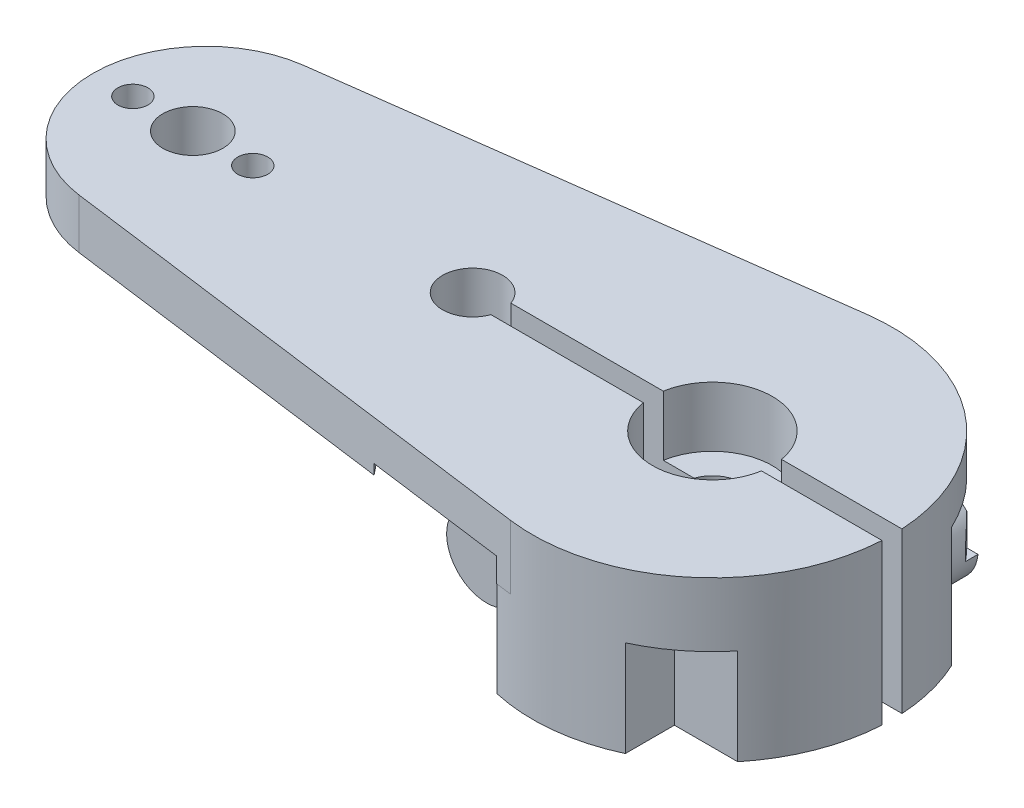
ISO-10303-21;
HEADER;
FILE_DESCRIPTION(('STEP AP214'),'2;1');
FILE_NAME('part.step','',(''),(''),'','','');
FILE_SCHEMA(('AUTOMOTIVE_DESIGN { 1 0 10303 214 1 1 1 1 }'));
ENDSEC;
DATA;
#1=APPLICATION_CONTEXT('core data for automotive mechanical design processes');
#2=APPLICATION_PROTOCOL_DEFINITION('international standard','automotive_design',2000,#1);
#3=PRODUCT_CONTEXT('',#1,'mechanical');
#4=PRODUCT('Part','Part','',(#3));
#5=PRODUCT_RELATED_PRODUCT_CATEGORY('part','',(#4));
#6=PRODUCT_DEFINITION_FORMATION('','',#4);
#7=PRODUCT_DEFINITION_CONTEXT('part definition',#1,'design');
#8=PRODUCT_DEFINITION('design','',#6,#7);
#9=PRODUCT_DEFINITION_SHAPE('','',#8);
#10=(LENGTH_UNIT() NAMED_UNIT(*) SI_UNIT(.MILLI.,.METRE.));
#11=(NAMED_UNIT(*) PLANE_ANGLE_UNIT() SI_UNIT($,.RADIAN.));
#12=(NAMED_UNIT(*) SI_UNIT($,.STERADIAN.) SOLID_ANGLE_UNIT());
#13=UNCERTAINTY_MEASURE_WITH_UNIT(LENGTH_MEASURE(1.E-05),#10,'distance_accuracy_value','');
#14=(GEOMETRIC_REPRESENTATION_CONTEXT(3) GLOBAL_UNCERTAINTY_ASSIGNED_CONTEXT((#13)) GLOBAL_UNIT_ASSIGNED_CONTEXT((#10,
#11,#12)) REPRESENTATION_CONTEXT('',''));
#15=CARTESIAN_POINT('',(0.,0.,0.));
#16=DIRECTION('',(0.,0.,1.));
#17=DIRECTION('',(1.,0.,0.));
#18=AXIS2_PLACEMENT_3D('',#15,#16,#17);
#19=CARTESIAN_POINT('',(-38.5263157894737,2.5,-3.96522277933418));
#20=DIRECTION('',(0.131578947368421,0.,0.991305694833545));
#21=DIRECTION('',(0.991305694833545,0.,-0.131578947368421));
#22=AXIS2_PLACEMENT_3D('',#19,#20,#21);
#23=PLANE('',#22);
#24=DIRECTION('',(0.,1.,0.));
#25=VECTOR('',#24,1.);
#26=CARTESIAN_POINT('',(-26.0789473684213,-5.5,-5.61739893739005));
#27=LINE('',#26,#25);
#28=CARTESIAN_POINT('',(-26.0789473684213,2.5,-5.61739893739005));
#29=VERTEX_POINT('',#28);
#30=CARTESIAN_POINT('',(-26.0789473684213,0.,-5.61739893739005));
#31=VERTEX_POINT('',#30);
#32=EDGE_CURVE('E11',#29,#31,#27,.F.);
#33=ORIENTED_EDGE('',*,*,#32,.F.);
#34=DIRECTION('',(-0.991305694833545,0.,0.131578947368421));
#35=VECTOR('',#34,1.);
#36=CARTESIAN_POINT('',(-38.5263157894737,2.5,-3.96522277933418));
#37=LINE('',#36,#35);
#38=CARTESIAN_POINT('',(-1.18421052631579,2.5,-8.92175125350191));
#39=VERTEX_POINT('',#38);
#40=EDGE_CURVE('E336',#39,#29,#37,.T.);
#41=ORIENTED_EDGE('',*,*,#40,.F.);
#42=DIRECTION('',(0.,-1.,0.));
#43=VECTOR('',#42,1.);
#44=CARTESIAN_POINT('',(-1.18421052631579,2.5,-8.92175125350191));
#45=LINE('',#44,#43);
#46=CARTESIAN_POINT('',(-1.18421052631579,-0.7,-8.92175125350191));
#47=VERTEX_POINT('',#46);
#48=EDGE_CURVE('E355',#39,#47,#45,.T.);
#49=ORIENTED_EDGE('',*,*,#48,.T.);
#50=DIRECTION('',(0.991305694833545,0.,-0.131578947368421));
#51=VECTOR('',#50,1.);
#52=CARTESIAN_POINT('',(-1.18421052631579,-0.7,-8.92175125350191));
#53=LINE('',#52,#51);
#54=CARTESIAN_POINT('',(-5.50521187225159,-0.7,-8.34821191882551));
#55=VERTEX_POINT('',#54);
#56=EDGE_CURVE('E522',#55,#47,#53,.T.);
#57=ORIENTED_EDGE('',*,*,#56,.F.);
#58=DIRECTION('',(0.,1.,0.));
#59=VECTOR('',#58,1.);
#60=CARTESIAN_POINT('',(-5.50521187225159,-0.7,-8.34821191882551));
#61=LINE('',#60,#59);
#62=CARTESIAN_POINT('',(-5.50521187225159,0.5,-8.34821191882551));
#63=VERTEX_POINT('',#62);
#64=EDGE_CURVE('E529',#55,#63,#61,.T.);
#65=ORIENTED_EDGE('',*,*,#64,.T.);
#66=DIRECTION('',(0.991305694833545,0.,-0.131578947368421));
#67=VECTOR('',#66,1.);
#68=CARTESIAN_POINT('',(-5.50521187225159,0.5,-8.34821191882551));
#69=LINE('',#68,#67);
#70=CARTESIAN_POINT('',(-9.05245555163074,0.5,-7.87737573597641));
#71=VERTEX_POINT('',#70);
#72=EDGE_CURVE('E502',#71,#63,#69,.T.);
#73=ORIENTED_EDGE('',*,*,#72,.F.);
#74=DIRECTION('',(0.,-1.,0.));
#75=VECTOR('',#74,1.);
#76=CARTESIAN_POINT('',(-9.05245555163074,0.5,-7.87737573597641));
#77=LINE('',#76,#75);
#78=CARTESIAN_POINT('',(-9.05245555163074,0.,-7.87737573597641));
#79=VERTEX_POINT('',#78);
#80=EDGE_CURVE('E509',#71,#79,#77,.T.);
#81=ORIENTED_EDGE('',*,*,#80,.T.);
#82=DIRECTION('',(-0.991305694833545,0.,0.131578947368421));
#83=VECTOR('',#82,1.);
#84=CARTESIAN_POINT('',(-38.5263157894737,0.,-3.96522277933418));
#85=LINE('',#84,#83);
#86=EDGE_CURVE('E343',#79,#31,#85,.T.);
#87=ORIENTED_EDGE('',*,*,#86,.T.);
#88=EDGE_LOOP('',(#33,#41,#49,#57,#65,#73,#81,#87));
#89=FACE_BOUND('',#88,.T.);
#90=ADVANCED_FACE('F34',(#89),#23,.F.);
#91=CARTESIAN_POINT('',(2.,7.21685201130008,-3.8));
#92=DIRECTION('',(0.,0.,1.));
#93=DIRECTION('',(1.,0.,0.));
#94=AXIS2_PLACEMENT_3D('',#91,#92,#93);
#95=PLANE('',#94);
#96=CARTESIAN_POINT('',(5.,-2.3,-3.8));
#97=DIRECTION('',(0.,0.,1.));
#98=DIRECTION('',(1.,0.,0.));
#99=AXIS2_PLACEMENT_3D('',#96,#97,#98);
#100=CIRCLE('',#99,2.);
#101=CARTESIAN_POINT('',(7.,-2.3,-3.8));
#102=VERTEX_POINT('',#101);
#103=EDGE_CURVE('E371',#102,#102,#100,.F.);
#104=ORIENTED_EDGE('',*,*,#103,.F.);
#105=EDGE_LOOP('',(#104));
#106=FACE_BOUND('',#105,.T.);
#107=DIRECTION('',(1.,0.,0.));
#108=VECTOR('',#107,1.);
#109=CARTESIAN_POINT('',(9.24986486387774,0.5,-3.8));
#110=LINE('',#109,#108);
#111=CARTESIAN_POINT('',(2.,0.5,-3.8));
#112=VERTEX_POINT('',#111);
#113=CARTESIAN_POINT('',(8.15843122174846,0.5,-3.8));
#114=VERTEX_POINT('',#113);
#115=EDGE_CURVE('E664',#112,#114,#110,.T.);
#116=ORIENTED_EDGE('',*,*,#115,.T.);
#117=DIRECTION('',(0.,-1.,0.));
#118=VECTOR('',#117,1.);
#119=CARTESIAN_POINT('',(8.15843122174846,7.21685201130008,-3.8));
#120=LINE('',#119,#118);
#121=CARTESIAN_POINT('',(8.15843122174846,-5.5,-3.8));
#122=VERTEX_POINT('',#121);
#123=EDGE_CURVE('E681',#114,#122,#120,.T.);
#124=ORIENTED_EDGE('',*,*,#123,.T.);
#125=DIRECTION('',(-1.,0.,0.));
#126=VECTOR('',#125,1.);
#127=CARTESIAN_POINT('',(2.,-5.5,-3.8));
#128=LINE('',#127,#126);
#129=CARTESIAN_POINT('',(2.,-5.5,-3.8));
#130=VERTEX_POINT('',#129);
#131=EDGE_CURVE('E676',#122,#130,#128,.T.);
#132=ORIENTED_EDGE('',*,*,#131,.T.);
#133=DIRECTION('',(0.,-1.,0.));
#134=VECTOR('',#133,1.);
#135=CARTESIAN_POINT('',(2.,7.21685201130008,-3.8));
#136=LINE('',#135,#134);
#137=EDGE_CURVE('E680',#112,#130,#136,.T.);
#138=ORIENTED_EDGE('',*,*,#137,.F.);
#139=EDGE_LOOP('',(#116,#124,#132,#138));
#140=FACE_BOUND('',#139,.T.);
#141=ADVANCED_FACE('F556',(#106,#140),#95,.F.);
#142=CARTESIAN_POINT('',(-10.5857864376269,-5.5,0.5));
#143=DIRECTION('',(0.,0.,1.));
#144=DIRECTION('',(1.,0.,0.));
#145=AXIS2_PLACEMENT_3D('',#142,#143,#144);
#146=PLANE('',#145);
#147=CARTESIAN_POINT('',(5.,-2.3,0.499999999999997));
#148=DIRECTION('',(0.,0.,1.));
#149=DIRECTION('',(1.,0.,0.));
#150=AXIS2_PLACEMENT_3D('',#147,#148,#149);
#151=CIRCLE('',#150,1.25);
#152=CARTESIAN_POINT('',(6.25,-2.3,0.499999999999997));
#153=VERTEX_POINT('',#152);
#154=EDGE_CURVE('E643',#153,#153,#151,.T.);
#155=ORIENTED_EDGE('',*,*,#154,.T.);
#156=EDGE_LOOP('',(#155));
#157=FACE_BOUND('',#156,.T.);
#158=DIRECTION('',(1.,0.,0.));
#159=VECTOR('',#158,1.);
#160=CARTESIAN_POINT('',(-10.5857864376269,2.5,0.5));
#161=LINE('',#160,#159);
#162=CARTESIAN_POINT('',(2.95803989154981,2.5,0.499999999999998));
#163=VERTEX_POINT('',#162);
#164=CARTESIAN_POINT('',(8.98610037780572,2.5,0.499999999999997));
#165=VERTEX_POINT('',#164);
#166=EDGE_CURVE('E450',#163,#165,#161,.T.);
#167=ORIENTED_EDGE('',*,*,#166,.T.);
#168=DIRECTION('',(0.,-1.,0.));
#169=VECTOR('',#168,1.);
#170=CARTESIAN_POINT('',(8.98610037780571,2.5,0.499999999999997));
#171=LINE('',#170,#169);
#172=CARTESIAN_POINT('',(8.98610037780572,-5.5,0.499999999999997));
#173=VERTEX_POINT('',#172);
#174=EDGE_CURVE('E469',#173,#165,#171,.F.);
#175=ORIENTED_EDGE('',*,*,#174,.F.);
#176=DIRECTION('',(1.,0.,0.));
#177=VECTOR('',#176,1.);
#178=CARTESIAN_POINT('',(-10.5857864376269,-5.5,0.5));
#179=LINE('',#178,#177);
#180=CARTESIAN_POINT('',(2.95803989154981,-5.5,0.499999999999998));
#181=VERTEX_POINT('',#180);
#182=EDGE_CURVE('E437',#181,#173,#179,.T.);
#183=ORIENTED_EDGE('',*,*,#182,.F.);
#184=DIRECTION('',(0.,-1.,0.));
#185=VECTOR('',#184,1.);
#186=CARTESIAN_POINT('',(2.95803989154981,-2.,0.499999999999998));
#187=LINE('',#186,#185);
#188=CARTESIAN_POINT('',(2.95803989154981,-2.,0.499999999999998));
#189=VERTEX_POINT('',#188);
#190=EDGE_CURVE('E750',#181,#189,#187,.F.);
#191=ORIENTED_EDGE('',*,*,#190,.T.);
#192=DIRECTION('',(1.,0.,0.));
#193=VECTOR('',#192,1.);
#194=CARTESIAN_POINT('',(-10.5857864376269,-2.,0.5));
#195=LINE('',#194,#193);
#196=CARTESIAN_POINT('',(1.4142135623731,-2.,0.499999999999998));
#197=VERTEX_POINT('',#196);
#198=EDGE_CURVE('E739',#197,#189,#195,.T.);
#199=ORIENTED_EDGE('',*,*,#198,.F.);
#200=DIRECTION('',(0.,1.,0.));
#201=VECTOR('',#200,1.);
#202=CARTESIAN_POINT('',(1.4142135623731,-5.5,0.499999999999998));
#203=LINE('',#202,#201);
#204=CARTESIAN_POINT('',(1.4142135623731,-0.5,0.499999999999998));
#205=VERTEX_POINT('',#204);
#206=EDGE_CURVE('E761',#197,#205,#203,.T.);
#207=ORIENTED_EDGE('',*,*,#206,.T.);
#208=DIRECTION('',(-1.,0.,0.));
#209=VECTOR('',#208,1.);
#210=CARTESIAN_POINT('',(-10.5857864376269,-0.5,0.5));
#211=LINE('',#210,#209);
#212=CARTESIAN_POINT('',(2.95803989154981,-0.5,0.499999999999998));
#213=VERTEX_POINT('',#212);
#214=EDGE_CURVE('E399',#213,#205,#211,.T.);
#215=ORIENTED_EDGE('',*,*,#214,.F.);
#216=DIRECTION('',(0.,1.,0.));
#217=VECTOR('',#216,1.);
#218=CARTESIAN_POINT('',(2.95803989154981,-0.5,0.499999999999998));
#219=LINE('',#218,#217);
#220=EDGE_CURVE('E406',#213,#163,#219,.T.);
#221=ORIENTED_EDGE('',*,*,#220,.T.);
#222=EDGE_LOOP('',(#167,#175,#183,#191,#199,#207,#215,#221));
#223=FACE_BOUND('',#222,.T.);
#224=ADVANCED_FACE('F564',(#157,#223),#146,.F.);
#225=CARTESIAN_POINT('',(0.,0.5,0.));
#226=DIRECTION('',(0.,-1.,0.));
#227=DIRECTION('',(0.,0.,-1.));
#228=AXIS2_PLACEMENT_3D('',#225,#226,#227);
#229=PLANE('',#228);
#230=DIRECTION('',(0.,0.,1.));
#231=VECTOR('',#230,1.);
#232=CARTESIAN_POINT('',(2.,0.5,-3.8));
#233=LINE('',#232,#231);
#234=CARTESIAN_POINT('',(2.,0.5,-8.77496438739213));
#235=VERTEX_POINT('',#234);
#236=EDGE_CURVE('E674',#235,#112,#233,.T.);
#237=ORIENTED_EDGE('',*,*,#236,.F.);
#238=CARTESIAN_POINT('',(0.,0.5,0.));
#239=DIRECTION('',(0.,-1.,0.));
#240=DIRECTION('',(0.,0.,-1.));
#241=AXIS2_PLACEMENT_3D('',#238,#239,#240);
#242=CIRCLE('',#241,9.00000000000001);
#243=EDGE_CURVE('E608',#235,#114,#242,.T.);
#244=ORIENTED_EDGE('',*,*,#243,.T.);
#245=ORIENTED_EDGE('',*,*,#115,.F.);
#246=EDGE_LOOP('',(#237,#244,#245));
#247=FACE_BOUND('',#246,.T.);
#248=ADVANCED_FACE('F582',(#247),#229,.T.);
#249=CARTESIAN_POINT('',(0.,-0.7,0.));
#250=DIRECTION('',(0.,-1.,0.));
#251=DIRECTION('',(0.,0.,-1.));
#252=AXIS2_PLACEMENT_3D('',#249,#250,#251);
#253=PLANE('',#252);
#254=DIRECTION('',(-1.,0.,0.));
#255=VECTOR('',#254,1.);
#256=CARTESIAN_POINT('',(3.8,-0.699999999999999,5.7));
#257=LINE('',#256,#255);
#258=CARTESIAN_POINT('',(6.96491205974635,-0.699999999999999,5.7));
#259=VERTEX_POINT('',#258);
#260=CARTESIAN_POINT('',(3.8,-0.699999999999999,5.7));
#261=VERTEX_POINT('',#260);
#262=EDGE_CURVE('E703',#259,#261,#257,.T.);
#263=ORIENTED_EDGE('',*,*,#262,.F.);
#264=CARTESIAN_POINT('',(0.,-0.7,0.));
#265=DIRECTION('',(0.,-1.,0.));
#266=DIRECTION('',(0.,0.,-1.));
#267=AXIS2_PLACEMENT_3D('',#264,#265,#266);
#268=CIRCLE('',#267,9.00000000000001);
#269=CARTESIAN_POINT('',(3.8,-0.699999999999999,8.15843122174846));
#270=VERTEX_POINT('',#269);
#271=EDGE_CURVE('E640',#259,#270,#268,.T.);
#272=ORIENTED_EDGE('',*,*,#271,.T.);
#273=DIRECTION('',(0.,0.,1.));
#274=VECTOR('',#273,1.);
#275=CARTESIAN_POINT('',(3.8,-0.699999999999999,8.15843122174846));
#276=LINE('',#275,#274);
#277=EDGE_CURVE('E705',#261,#270,#276,.T.);
#278=ORIENTED_EDGE('',*,*,#277,.F.);
#279=EDGE_LOOP('',(#263,#272,#278));
#280=FACE_BOUND('',#279,.T.);
#281=ADVANCED_FACE('F572',(#280),#253,.T.);
#282=CARTESIAN_POINT('',(-38.,2.5,0.));
#283=DIRECTION('',(0.,1.,0.));
#284=DIRECTION('',(0.,0.,1.));
#285=AXIS2_PLACEMENT_3D('',#282,#283,#284);
#286=PLANE('',#285);
#287=CARTESIAN_POINT('',(-26.,2.5,0.));
#288=DIRECTION('',(0.,1.,0.));
#289=DIRECTION('',(0.,0.,1.));
#290=AXIS2_PLACEMENT_3D('',#287,#288,#289);
#291=CIRCLE('',#290,1.5);
#292=CARTESIAN_POINT('',(-26.,2.5,1.5));
#293=VERTEX_POINT('',#292);
#294=EDGE_CURVE('E589',#293,#293,#291,.T.);
#295=ORIENTED_EDGE('',*,*,#294,.F.);
#296=EDGE_LOOP('',(#295));
#297=FACE_BOUND('',#296,.T.);
#298=CARTESIAN_POINT('',(-25.3333333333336,2.5,0.));
#299=DIRECTION('',(0.,-1.,0.));
#300=DIRECTION('',(0.,0.,1.));
#301=AXIS2_PLACEMENT_3D('',#298,#299,#300);
#302=CIRCLE('',#301,5.66666666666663);
#303=CARTESIAN_POINT('',(-26.0789473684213,2.5,5.61739893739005));
#304=VERTEX_POINT('',#303);
#305=EDGE_CURVE('E50',#304,#29,#302,.T.);
#306=ORIENTED_EDGE('',*,*,#305,.F.);
#307=DIRECTION('',(0.991305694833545,0.,0.131578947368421));
#308=VECTOR('',#307,1.);
#309=CARTESIAN_POINT('',(-1.18421052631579,2.5,8.92175125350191));
#310=LINE('',#309,#308);
#311=CARTESIAN_POINT('',(-1.18421052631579,2.5,8.92175125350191));
#312=VERTEX_POINT('',#311);
#313=EDGE_CURVE('E333',#304,#312,#310,.T.);
#314=ORIENTED_EDGE('',*,*,#313,.T.);
#315=CARTESIAN_POINT('',(0.,2.5,0.));
#316=DIRECTION('',(0.,1.,0.));
#317=DIRECTION('',(0.,0.,1.));
#318=AXIS2_PLACEMENT_3D('',#315,#316,#317);
#319=CIRCLE('',#318,9.);
#320=EDGE_CURVE('E342',#312,#165,#319,.T.);
#321=ORIENTED_EDGE('',*,*,#320,.T.);
#322=ORIENTED_EDGE('',*,*,#166,.F.);
#323=CARTESIAN_POINT('',(0.,2.5,0.));
#324=DIRECTION('',(0.,1.,0.));
#325=DIRECTION('',(0.,0.,1.));
#326=AXIS2_PLACEMENT_3D('',#323,#324,#325);
#327=CIRCLE('',#326,3.);
#328=CARTESIAN_POINT('',(-2.95803989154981,2.5,0.499999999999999));
#329=VERTEX_POINT('',#328);
#330=EDGE_CURVE('E768',#329,#163,#327,.T.);
#331=ORIENTED_EDGE('',*,*,#330,.F.);
#332=CARTESIAN_POINT('',(-10.5857864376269,2.5,0.5));
#333=VERTEX_POINT('',#332);
#334=EDGE_CURVE('E451',#333,#329,#161,.T.);
#335=ORIENTED_EDGE('',*,*,#334,.F.);
#336=CARTESIAN_POINT('',(-12.,2.5,0.));
#337=DIRECTION('',(0.,1.,0.));
#338=DIRECTION('',(0.,0.,1.));
#339=AXIS2_PLACEMENT_3D('',#336,#337,#338);
#340=CIRCLE('',#339,1.5);
#341=CARTESIAN_POINT('',(-10.5857864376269,2.5,-0.5));
#342=VERTEX_POINT('',#341);
#343=EDGE_CURVE('E448',#342,#333,#340,.T.);
#344=ORIENTED_EDGE('',*,*,#343,.F.);
#345=DIRECTION('',(-1.,0.,0.));
#346=VECTOR('',#345,1.);
#347=CARTESIAN_POINT('',(-10.5857864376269,2.5,-0.5));
#348=LINE('',#347,#346);
#349=CARTESIAN_POINT('',(-2.95803989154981,2.5,-0.500000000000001));
#350=VERTEX_POINT('',#349);
#351=EDGE_CURVE('E454',#350,#342,#348,.T.);
#352=ORIENTED_EDGE('',*,*,#351,.F.);
#353=CARTESIAN_POINT('',(2.95803989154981,2.5,-0.500000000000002));
#354=VERTEX_POINT('',#353);
#355=EDGE_CURVE('E772',#354,#350,#327,.T.);
#356=ORIENTED_EDGE('',*,*,#355,.F.);
#357=CARTESIAN_POINT('',(8.98610037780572,2.5,-0.500000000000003));
#358=VERTEX_POINT('',#357);
#359=EDGE_CURVE('E441',#358,#354,#348,.T.);
#360=ORIENTED_EDGE('',*,*,#359,.F.);
#361=CARTESIAN_POINT('',(0.,2.5,0.));
#362=DIRECTION('',(0.,1.,0.));
#363=DIRECTION('',(0.,0.,1.));
#364=AXIS2_PLACEMENT_3D('',#361,#362,#363);
#365=CIRCLE('',#364,9.);
#366=EDGE_CURVE('E345',#358,#39,#365,.T.);
#367=ORIENTED_EDGE('',*,*,#366,.T.);
#368=ORIENTED_EDGE('',*,*,#40,.T.);
#369=EDGE_LOOP('',(#306,#314,#321,#322,#331,#335,#344,#352,#356,#360,#367,#368));
#370=FACE_BOUND('',#369,.T.);
#371=CARTESIAN_POINT('',(-23.,2.5,0.));
#372=DIRECTION('',(0.,1.,0.));
#373=DIRECTION('',(0.,0.,1.));
#374=AXIS2_PLACEMENT_3D('',#371,#372,#373);
#375=CIRCLE('',#374,0.750000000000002);
#376=CARTESIAN_POINT('',(-23.,2.5,0.750000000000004));
#377=VERTEX_POINT('',#376);
#378=EDGE_CURVE('E524',#377,#377,#375,.T.);
#379=ORIENTED_EDGE('',*,*,#378,.F.);
#380=EDGE_LOOP('',(#379));
#381=FACE_BOUND('',#380,.T.);
#382=CARTESIAN_POINT('',(-29.,2.5,0.));
#383=DIRECTION('',(0.,1.,0.));
#384=DIRECTION('',(0.,0.,1.));
#385=AXIS2_PLACEMENT_3D('',#382,#383,#384);
#386=CIRCLE('',#385,0.750000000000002);
#387=CARTESIAN_POINT('',(-29.,2.5,0.750000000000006));
#388=VERTEX_POINT('',#387);
#389=EDGE_CURVE('E360',#388,#388,#386,.T.);
#390=ORIENTED_EDGE('',*,*,#389,.F.);
#391=EDGE_LOOP('',(#390));
#392=FACE_BOUND('',#391,.T.);
#393=ADVANCED_FACE('F330',(#297,#370,#381,#392),#286,.T.);
#394=CARTESIAN_POINT('',(-10.5857864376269,-5.5,-0.5));
#395=DIRECTION('',(0.,0.,-1.));
#396=DIRECTION('',(-1.,0.,0.));
#397=AXIS2_PLACEMENT_3D('',#394,#395,#396);
#398=PLANE('',#397);
#399=CARTESIAN_POINT('',(5.,-2.3,-0.500000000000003));
#400=DIRECTION('',(0.,0.,-1.));
#401=DIRECTION('',(-1.,0.,0.));
#402=AXIS2_PLACEMENT_3D('',#399,#400,#401);
#403=CIRCLE('',#402,1.25);
#404=CARTESIAN_POINT('',(3.75,-2.3,-0.500000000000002));
#405=VERTEX_POINT('',#404);
#406=EDGE_CURVE('E648',#405,#405,#403,.F.);
#407=ORIENTED_EDGE('',*,*,#406,.F.);
#408=EDGE_LOOP('',(#407));
#409=FACE_BOUND('',#408,.T.);
#410=DIRECTION('',(0.,-1.,0.));
#411=VECTOR('',#410,1.);
#412=CARTESIAN_POINT('',(8.98610037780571,2.5,-0.500000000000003));
#413=LINE('',#412,#411);
#414=CARTESIAN_POINT('',(8.98610037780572,-5.5,-0.500000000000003));
#415=VERTEX_POINT('',#414);
#416=EDGE_CURVE('E479',#358,#415,#413,.T.);
#417=ORIENTED_EDGE('',*,*,#416,.F.);
#418=ORIENTED_EDGE('',*,*,#359,.T.);
#419=DIRECTION('',(0.,1.,0.));
#420=VECTOR('',#419,1.);
#421=CARTESIAN_POINT('',(2.95803989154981,-0.5,-0.500000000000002));
#422=LINE('',#421,#420);
#423=CARTESIAN_POINT('',(2.95803989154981,-0.5,-0.500000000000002));
#424=VERTEX_POINT('',#423);
#425=EDGE_CURVE('E776',#354,#424,#422,.F.);
#426=ORIENTED_EDGE('',*,*,#425,.T.);
#427=DIRECTION('',(1.,0.,0.));
#428=VECTOR('',#427,1.);
#429=CARTESIAN_POINT('',(-10.5857864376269,-0.5,-0.5));
#430=LINE('',#429,#428);
#431=CARTESIAN_POINT('',(1.41421356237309,-0.5,-0.500000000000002));
#432=VERTEX_POINT('',#431);
#433=EDGE_CURVE('E777',#432,#424,#430,.T.);
#434=ORIENTED_EDGE('',*,*,#433,.F.);
#435=DIRECTION('',(0.,1.,0.));
#436=VECTOR('',#435,1.);
#437=CARTESIAN_POINT('',(1.41421356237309,-5.5,-0.500000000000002));
#438=LINE('',#437,#436);
#439=CARTESIAN_POINT('',(1.41421356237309,-2.,-0.500000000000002));
#440=VERTEX_POINT('',#439);
#441=EDGE_CURVE('E763',#432,#440,#438,.F.);
#442=ORIENTED_EDGE('',*,*,#441,.T.);
#443=DIRECTION('',(-1.,0.,0.));
#444=VECTOR('',#443,1.);
#445=CARTESIAN_POINT('',(-10.5857864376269,-2.,-0.5));
#446=LINE('',#445,#444);
#447=CARTESIAN_POINT('',(2.95803989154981,-2.,-0.500000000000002));
#448=VERTEX_POINT('',#447);
#449=EDGE_CURVE('E743',#448,#440,#446,.T.);
#450=ORIENTED_EDGE('',*,*,#449,.F.);
#451=DIRECTION('',(0.,-1.,0.));
#452=VECTOR('',#451,1.);
#453=CARTESIAN_POINT('',(2.95803989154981,-2.,-0.500000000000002));
#454=LINE('',#453,#452);
#455=CARTESIAN_POINT('',(2.95803989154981,-5.5,-0.500000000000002));
#456=VERTEX_POINT('',#455);
#457=EDGE_CURVE('E747',#448,#456,#454,.T.);
#458=ORIENTED_EDGE('',*,*,#457,.T.);
#459=DIRECTION('',(-1.,0.,0.));
#460=VECTOR('',#459,1.);
#461=CARTESIAN_POINT('',(-10.5857864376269,-5.5,-0.5));
#462=LINE('',#461,#460);
#463=EDGE_CURVE('E439',#415,#456,#462,.T.);
#464=ORIENTED_EDGE('',*,*,#463,.F.);
#465=EDGE_LOOP('',(#417,#418,#426,#434,#442,#450,#458,#464));
#466=FACE_BOUND('',#465,.T.);
#467=ADVANCED_FACE('F571',(#409,#466),#398,.F.);
#468=CARTESIAN_POINT('',(2.,7.21685201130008,-8.77496438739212));
#469=DIRECTION('',(-1.,0.,0.));
#470=DIRECTION('',(0.,0.,1.));
#471=AXIS2_PLACEMENT_3D('',#468,#469,#470);
#472=PLANE('',#471);
#473=DIRECTION('',(0.,-1.,0.));
#474=VECTOR('',#473,1.);
#475=CARTESIAN_POINT('',(2.,7.21685201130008,-8.77496438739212));
#476=LINE('',#475,#474);
#477=CARTESIAN_POINT('',(2.,-5.5,-8.77496438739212));
#478=VERTEX_POINT('',#477);
#479=EDGE_CURVE('E58',#235,#478,#476,.T.);
#480=ORIENTED_EDGE('',*,*,#479,.F.);
#481=ORIENTED_EDGE('',*,*,#236,.T.);
#482=ORIENTED_EDGE('',*,*,#137,.T.);
#483=DIRECTION('',(0.,0.,-1.));
#484=VECTOR('',#483,1.);
#485=CARTESIAN_POINT('',(2.,-5.5,-8.77496438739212));
#486=LINE('',#485,#484);
#487=EDGE_CURVE('E678',#130,#478,#486,.T.);
#488=ORIENTED_EDGE('',*,*,#487,.T.);
#489=EDGE_LOOP('',(#480,#481,#482,#488));
#490=FACE_BOUND('',#489,.T.);
#491=ADVANCED_FACE('F577',(#490),#472,.F.);
#492=CARTESIAN_POINT('',(5.,-2.3,-6.3));
#493=DIRECTION('',(0.,0.,1.));
#494=DIRECTION('',(1.,0.,0.));
#495=AXIS2_PLACEMENT_3D('',#492,#493,#494);
#496=CYLINDRICAL_SURFACE('',#495,2.);
#497=ORIENTED_EDGE('',*,*,#103,.T.);
#498=EDGE_LOOP('',(#497));
#499=FACE_BOUND('',#498,.T.);
#500=CARTESIAN_POINT('',(6.42728558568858,-0.898980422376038,-6.3));
#501=CARTESIAN_POINT('',(6.46255276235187,-0.934921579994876,-6.26402598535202));
#502=CARTESIAN_POINT('',(6.49673876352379,-0.972451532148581,-6.22853927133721));
#503=CARTESIAN_POINT('',(6.56278423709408,-1.050860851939,-6.15890836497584));
#504=CARTESIAN_POINT('',(6.59463871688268,-1.09174703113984,-6.12476712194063));
#505=CARTESIAN_POINT('',(6.65613892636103,-1.17749232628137,-6.0578800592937));
#506=CARTESIAN_POINT('',(6.68574715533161,-1.22239935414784,-6.02516072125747));
#507=CARTESIAN_POINT('',(6.74188377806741,-1.31572136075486,-5.96227968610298));
#508=CARTESIAN_POINT('',(6.76841481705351,-1.36413326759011,-5.93211579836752));
#509=CARTESIAN_POINT('',(6.8277575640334,-1.48428816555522,-5.86382889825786));
#510=CARTESIAN_POINT('',(6.85895004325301,-1.55773335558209,-5.82722575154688));
#511=CARTESIAN_POINT('',(6.91301387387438,-1.71099336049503,-5.76298605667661));
#512=CARTESIAN_POINT('',(6.93592453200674,-1.79077583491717,-5.73530722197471));
#513=CARTESIAN_POINT('',(6.96906183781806,-1.94247093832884,-5.69497591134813));
#514=CARTESIAN_POINT('',(6.9807277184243,-2.01361243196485,-5.68063205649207));
#515=CARTESIAN_POINT('',(6.99627051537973,-2.15803597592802,-5.66148063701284));
#516=CARTESIAN_POINT('',(7.00015387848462,-2.23131620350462,-5.65666517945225));
#517=CARTESIAN_POINT('',(6.99992382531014,-2.33724381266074,-5.65694790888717));
#518=CARTESIAN_POINT('',(6.99904283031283,-2.36997571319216,-5.65803922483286));
#519=CARTESIAN_POINT('',(6.99569158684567,-2.43519967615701,-5.66218200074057));
#520=CARTESIAN_POINT('',(6.9932229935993,-2.46769195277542,-5.66523141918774));
#521=CARTESIAN_POINT('',(6.98997487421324,-2.5,-5.66923727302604));
#522=B_SPLINE_CURVE_WITH_KNOTS('',3,(#500,#501,#502,#503,#504,#505,#506,#507,#508,#509,#510,
#511,#512,#513,#514,#515,#516,#517,#518,#519,#520,#521),.UNSPECIFIED.,.F.,.F.,(4,2,2,2,2,2,2,2,
2,2,4),(0.,0.185655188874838,0.371696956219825,0.560363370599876,0.748866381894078,
1.01131947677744,1.27251004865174,1.49208994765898,1.7114878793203,1.80969085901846,
1.90779161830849),.UNSPECIFIED.);
#523=CARTESIAN_POINT('',(6.42728558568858,-0.898980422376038,-6.3));
#524=VERTEX_POINT('',#523);
#525=CARTESIAN_POINT('',(6.98997487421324,-2.5,-5.66923727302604));
#526=VERTEX_POINT('',#525);
#527=EDGE_CURVE('E601',#524,#526,#522,.T.);
#528=ORIENTED_EDGE('',*,*,#527,.F.);
#529=CARTESIAN_POINT('',(5.,-2.3,-6.3));
#530=DIRECTION('',(0.,0.,-1.));
#531=DIRECTION('',(-1.,0.,0.));
#532=AXIS2_PLACEMENT_3D('',#529,#530,#531);
#533=CIRCLE('',#532,2.);
#534=CARTESIAN_POINT('',(6.98997487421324,-2.5,-6.3));
#535=VERTEX_POINT('',#534);
#536=EDGE_CURVE('E636',#535,#524,#533,.T.);
#537=ORIENTED_EDGE('',*,*,#536,.F.);
#538=DIRECTION('',(0.,0.,1.));
#539=VECTOR('',#538,1.);
#540=CARTESIAN_POINT('',(6.98997487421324,-2.5,-6.3));
#541=LINE('',#540,#539);
#542=EDGE_CURVE('E598',#535,#526,#541,.T.);
#543=ORIENTED_EDGE('',*,*,#542,.T.);
#544=EDGE_LOOP('',(#528,#537,#543));
#545=FACE_BOUND('',#544,.T.);
#546=ADVANCED_FACE('F610',(#499,#545),#496,.T.);
#547=CARTESIAN_POINT('',(5.,-2.3,-6.3));
#548=DIRECTION('',(0.,0.,-1.));
#549=DIRECTION('',(-1.,0.,0.));
#550=AXIS2_PLACEMENT_3D('',#547,#548,#549);
#551=PLANE('',#550);
#552=ORIENTED_EDGE('',*,*,#536,.T.);
#553=DIRECTION('',(0.,1.,0.));
#554=VECTOR('',#553,1.);
#555=CARTESIAN_POINT('',(6.42728558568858,-2.5,-6.3));
#556=LINE('',#555,#554);
#557=CARTESIAN_POINT('',(6.42728558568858,-2.5,-6.3));
#558=VERTEX_POINT('',#557);
#559=EDGE_CURVE('E43',#524,#558,#556,.F.);
#560=ORIENTED_EDGE('',*,*,#559,.T.);
#561=DIRECTION('',(-1.,0.,0.));
#562=VECTOR('',#561,1.);
#563=CARTESIAN_POINT('',(5.,-2.5,-6.3));
#564=LINE('',#563,#562);
#565=EDGE_CURVE('E369',#535,#558,#564,.T.);
#566=ORIENTED_EDGE('',*,*,#565,.F.);
#567=EDGE_LOOP('',(#552,#560,#566));
#568=FACE_BOUND('',#567,.T.);
#569=ADVANCED_FACE('F621',(#568),#551,.T.);
#570=CARTESIAN_POINT('',(-8.15843122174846,7.21685201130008,3.8));
#571=DIRECTION('',(0.,0.,-1.));
#572=DIRECTION('',(-1.,0.,0.));
#573=AXIS2_PLACEMENT_3D('',#570,#571,#572);
#574=PLANE('',#573);
#575=DIRECTION('',(0.,-1.,0.));
#576=VECTOR('',#575,1.);
#577=CARTESIAN_POINT('',(-2.,7.21685201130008,3.8));
#578=LINE('',#577,#576);
#579=CARTESIAN_POINT('',(-2.,0.5,3.8));
#580=VERTEX_POINT('',#579);
#581=CARTESIAN_POINT('',(-2.,-5.5,3.8));
#582=VERTEX_POINT('',#581);
#583=EDGE_CURVE('E730',#580,#582,#578,.T.);
#584=ORIENTED_EDGE('',*,*,#583,.F.);
#585=DIRECTION('',(-1.,0.,0.));
#586=VECTOR('',#585,1.);
#587=CARTESIAN_POINT('',(-9.24986486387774,0.5,3.8));
#588=LINE('',#587,#586);
#589=CARTESIAN_POINT('',(-9.24986486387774,0.5,3.8));
#590=VERTEX_POINT('',#589);
#591=EDGE_CURVE('E658',#580,#590,#588,.T.);
#592=ORIENTED_EDGE('',*,*,#591,.T.);
#593=DIRECTION('',(0.,-1.,0.));
#594=VECTOR('',#593,1.);
#595=CARTESIAN_POINT('',(-9.24986486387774,9.31450015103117,3.8));
#596=LINE('',#595,#594);
#597=CARTESIAN_POINT('',(-9.24986486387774,-0.7,3.8));
#598=VERTEX_POINT('',#597);
#599=EDGE_CURVE('E661',#590,#598,#596,.T.);
#600=ORIENTED_EDGE('',*,*,#599,.T.);
#601=DIRECTION('',(1.,0.,0.));
#602=VECTOR('',#601,1.);
#603=CARTESIAN_POINT('',(-9.24986486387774,-0.7,3.8));
#604=LINE('',#603,#602);
#605=CARTESIAN_POINT('',(-8.15843122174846,-0.699999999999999,3.8));
#606=VERTEX_POINT('',#605);
#607=EDGE_CURVE('E666',#598,#606,#604,.T.);
#608=ORIENTED_EDGE('',*,*,#607,.T.);
#609=DIRECTION('',(0.,-1.,0.));
#610=VECTOR('',#609,1.);
#611=CARTESIAN_POINT('',(-8.15843122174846,7.21685201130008,3.8));
#612=LINE('',#611,#610);
#613=CARTESIAN_POINT('',(-8.15843122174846,-5.5,3.8));
#614=VERTEX_POINT('',#613);
#615=EDGE_CURVE('E725',#606,#614,#612,.T.);
#616=ORIENTED_EDGE('',*,*,#615,.T.);
#617=DIRECTION('',(1.,0.,0.));
#618=VECTOR('',#617,1.);
#619=CARTESIAN_POINT('',(-8.15843122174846,-5.5,3.8));
#620=LINE('',#619,#618);
#621=EDGE_CURVE('E719',#614,#582,#620,.T.);
#622=ORIENTED_EDGE('',*,*,#621,.T.);
#623=EDGE_LOOP('',(#584,#592,#600,#608,#616,#622));
#624=FACE_BOUND('',#623,.T.);
#625=CARTESIAN_POINT('',(-5.,-2.3,3.8));
#626=DIRECTION('',(0.,0.,-1.));
#627=DIRECTION('',(-1.,0.,0.));
#628=AXIS2_PLACEMENT_3D('',#625,#626,#627);
#629=CIRCLE('',#628,2.);
#630=CARTESIAN_POINT('',(-7.,-2.3,3.8));
#631=VERTEX_POINT('',#630);
#632=EDGE_CURVE('E374',#631,#631,#629,.F.);
#633=ORIENTED_EDGE('',*,*,#632,.F.);
#634=EDGE_LOOP('',(#633));
#635=FACE_BOUND('',#634,.T.);
#636=ADVANCED_FACE('F623',(#624,#635),#574,.F.);
#637=DIRECTION('',(0.,0.,1.));
#638=VECTOR('',#637,1.);
#639=CARTESIAN_POINT('',(-2.,-0.7,3.8));
#640=LINE('',#639,#638);
#641=CARTESIAN_POINT('',(-2.,-0.7,8.77496438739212));
#642=VERTEX_POINT('',#641);
#643=CARTESIAN_POINT('',(-2.,-0.7,8.81346909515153));
#644=VERTEX_POINT('',#643);
#645=EDGE_CURVE('E657',#642,#644,#640,.T.);
#646=ORIENTED_EDGE('',*,*,#645,.F.);
#647=CARTESIAN_POINT('',(0.,-0.7,0.));
#648=DIRECTION('',(0.,-1.,0.));
#649=DIRECTION('',(0.,0.,-1.));
#650=AXIS2_PLACEMENT_3D('',#647,#648,#649);
#651=CIRCLE('',#650,9.);
#652=CARTESIAN_POINT('',(-1.18421052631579,-0.7,8.92175125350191));
#653=VERTEX_POINT('',#652);
#654=EDGE_CURVE('E388',#653,#642,#651,.T.);
#655=ORIENTED_EDGE('',*,*,#654,.F.);
#656=DIRECTION('',(-0.991305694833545,0.,-0.131578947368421));
#657=VECTOR('',#656,1.);
#658=CARTESIAN_POINT('',(-5.50521187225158,-0.7,8.34821191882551));
#659=LINE('',#658,#657);
#660=EDGE_CURVE('E812',#653,#644,#659,.T.);
#661=ORIENTED_EDGE('',*,*,#660,.T.);
#662=EDGE_LOOP('',(#646,#655,#661));
#663=FACE_BOUND('',#662,.T.);
#664=ADVANCED_FACE('F585',(#663),#253,.T.);
#665=CARTESIAN_POINT('',(0.,2.5,0.));
#666=DIRECTION('',(0.,-1.,0.));
#667=DIRECTION('',(0.,0.,-1.));
#668=AXIS2_PLACEMENT_3D('',#665,#666,#667);
#669=CYLINDRICAL_SURFACE('',#668,9.);
#670=CARTESIAN_POINT('',(-8.98610037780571,-0.7,-0.5));
#671=VERTEX_POINT('',#670);
#672=CARTESIAN_POINT('',(-6.96491205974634,-0.699999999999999,-5.7));
#673=VERTEX_POINT('',#672);
#674=EDGE_CURVE('E381',#671,#673,#651,.T.);
#675=ORIENTED_EDGE('',*,*,#674,.T.);
#676=DIRECTION('',(0.,-1.,0.));
#677=VECTOR('',#676,1.);
#678=CARTESIAN_POINT('',(-6.96491205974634,7.21685201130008,-5.7));
#679=LINE('',#678,#677);
#680=CARTESIAN_POINT('',(-6.96491205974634,-5.5,-5.7));
#681=VERTEX_POINT('',#680);
#682=EDGE_CURVE('E690',#673,#681,#679,.T.);
#683=ORIENTED_EDGE('',*,*,#682,.T.);
#684=CARTESIAN_POINT('',(0.,-5.5,0.));
#685=DIRECTION('',(0.,-1.,0.));
#686=DIRECTION('',(0.,0.,-1.));
#687=AXIS2_PLACEMENT_3D('',#684,#685,#686);
#688=CIRCLE('',#687,9.);
#689=CARTESIAN_POINT('',(-8.98610037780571,-5.5,-0.5));
#690=VERTEX_POINT('',#689);
#691=EDGE_CURVE('E515',#690,#681,#688,.T.);
#692=ORIENTED_EDGE('',*,*,#691,.F.);
#693=DIRECTION('',(0.,-1.,0.));
#694=VECTOR('',#693,1.);
#695=CARTESIAN_POINT('',(-8.98610037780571,2.5,-0.5));
#696=LINE('',#695,#694);
#697=EDGE_CURVE('E476',#690,#671,#696,.F.);
#698=ORIENTED_EDGE('',*,*,#697,.T.);
#699=EDGE_LOOP('',(#675,#683,#692,#698));
#700=FACE_BOUND('',#699,.T.);
#701=ADVANCED_FACE('F552',(#700),#669,.T.);
#702=DIRECTION('',(0.,-1.,0.));
#703=VECTOR('',#702,1.);
#704=CARTESIAN_POINT('',(3.8,7.21685201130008,8.15843122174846));
#705=LINE('',#704,#703);
#706=CARTESIAN_POINT('',(3.8,-5.5,8.15843122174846));
#707=VERTEX_POINT('',#706);
#708=EDGE_CURVE('E712',#270,#707,#705,.T.);
#709=ORIENTED_EDGE('',*,*,#708,.F.);
#710=ORIENTED_EDGE('',*,*,#271,.F.);
#711=DIRECTION('',(0.,-1.,0.));
#712=VECTOR('',#711,1.);
#713=CARTESIAN_POINT('',(6.96491205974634,7.21685201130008,5.7));
#714=LINE('',#713,#712);
#715=CARTESIAN_POINT('',(6.96491205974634,-5.5,5.7));
#716=VERTEX_POINT('',#715);
#717=EDGE_CURVE('E706',#259,#716,#714,.T.);
#718=ORIENTED_EDGE('',*,*,#717,.T.);
#719=EDGE_CURVE('E519',#173,#716,#688,.T.);
#720=ORIENTED_EDGE('',*,*,#719,.F.);
#721=ORIENTED_EDGE('',*,*,#174,.T.);
#722=ORIENTED_EDGE('',*,*,#320,.F.);
#723=DIRECTION('',(0.,-1.,0.));
#724=VECTOR('',#723,1.);
#725=CARTESIAN_POINT('',(-1.18421052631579,2.5,8.92175125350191));
#726=LINE('',#725,#724);
#727=EDGE_CURVE('E340',#312,#653,#726,.T.);
#728=ORIENTED_EDGE('',*,*,#727,.T.);
#729=ORIENTED_EDGE('',*,*,#654,.T.);
#730=DIRECTION('',(0.,-1.,0.));
#731=VECTOR('',#730,1.);
#732=CARTESIAN_POINT('',(-2.,7.21685201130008,8.77496438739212));
#733=LINE('',#732,#731);
#734=CARTESIAN_POINT('',(-2.,-5.5,8.77496438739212));
#735=VERTEX_POINT('',#734);
#736=EDGE_CURVE('E726',#642,#735,#733,.T.);
#737=ORIENTED_EDGE('',*,*,#736,.T.);
#738=EDGE_CURVE('E837',#707,#735,#688,.T.);
#739=ORIENTED_EDGE('',*,*,#738,.F.);
#740=EDGE_LOOP('',(#709,#710,#718,#720,#721,#722,#728,#729,#737,#739));
#741=FACE_BOUND('',#740,.T.);
#742=ADVANCED_FACE('F914',(#741),#669,.T.);
#743=CARTESIAN_POINT('',(0.,-5.5,0.));
#744=DIRECTION('',(0.,1.,0.));
#745=DIRECTION('',(0.,0.,1.));
#746=AXIS2_PLACEMENT_3D('',#743,#744,#745);
#747=CYLINDRICAL_SURFACE('',#746,1.5);
#748=CARTESIAN_POINT('',(0.,-2.,0.));
#749=DIRECTION('',(0.,-1.,0.));
#750=DIRECTION('',(0.,0.,-1.));
#751=AXIS2_PLACEMENT_3D('',#748,#749,#750);
#752=CIRCLE('',#751,1.5);
#753=CARTESIAN_POINT('',(-1.41421356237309,-2.,-0.500000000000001));
#754=VERTEX_POINT('',#753);
#755=EDGE_CURVE('E741',#440,#754,#752,.F.);
#756=ORIENTED_EDGE('',*,*,#755,.F.);
#757=ORIENTED_EDGE('',*,*,#441,.F.);
#758=CARTESIAN_POINT('',(0.,-0.5,0.));
#759=DIRECTION('',(0.,1.,0.));
#760=DIRECTION('',(0.,0.,1.));
#761=AXIS2_PLACEMENT_3D('',#758,#759,#760);
#762=CIRCLE('',#761,1.5);
#763=CARTESIAN_POINT('',(-1.41421356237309,-0.5,-0.500000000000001));
#764=VERTEX_POINT('',#763);
#765=EDGE_CURVE('E409',#432,#764,#762,.T.);
#766=ORIENTED_EDGE('',*,*,#765,.T.);
#767=DIRECTION('',(0.,1.,0.));
#768=VECTOR('',#767,1.);
#769=CARTESIAN_POINT('',(-1.41421356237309,-5.5,-0.500000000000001));
#770=LINE('',#769,#768);
#771=EDGE_CURVE('E766',#754,#764,#770,.T.);
#772=ORIENTED_EDGE('',*,*,#771,.F.);
#773=EDGE_LOOP('',(#756,#757,#766,#772));
#774=FACE_BOUND('',#773,.T.);
#775=ADVANCED_FACE('F864',(#774),#747,.F.);
#776=CARTESIAN_POINT('',(0.,-2.,0.));
#777=DIRECTION('',(0.,-1.,0.));
#778=DIRECTION('',(0.,0.,-1.));
#779=AXIS2_PLACEMENT_3D('',#776,#777,#778);
#780=CIRCLE('',#779,1.5);
#781=CARTESIAN_POINT('',(-1.4142135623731,-2.,0.499999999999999));
#782=VERTEX_POINT('',#781);
#783=EDGE_CURVE('E412',#782,#197,#780,.F.);
#784=ORIENTED_EDGE('',*,*,#783,.F.);
#785=DIRECTION('',(0.,1.,0.));
#786=VECTOR('',#785,1.);
#787=CARTESIAN_POINT('',(-1.4142135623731,-5.5,0.499999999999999));
#788=LINE('',#787,#786);
#789=CARTESIAN_POINT('',(-1.4142135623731,-0.5,0.499999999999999));
#790=VERTEX_POINT('',#789);
#791=EDGE_CURVE('E759',#790,#782,#788,.F.);
#792=ORIENTED_EDGE('',*,*,#791,.F.);
#793=CARTESIAN_POINT('',(0.,-0.5,0.));
#794=DIRECTION('',(0.,1.,0.));
#795=DIRECTION('',(0.,0.,1.));
#796=AXIS2_PLACEMENT_3D('',#793,#794,#795);
#797=CIRCLE('',#796,1.5);
#798=EDGE_CURVE('E756',#790,#205,#797,.T.);
#799=ORIENTED_EDGE('',*,*,#798,.T.);
#800=ORIENTED_EDGE('',*,*,#206,.F.);
#801=EDGE_LOOP('',(#784,#792,#799,#800));
#802=FACE_BOUND('',#801,.T.);
#803=ADVANCED_FACE('F919',(#802),#747,.F.);
#804=CARTESIAN_POINT('',(-5.,-2.3,-0.5));
#805=DIRECTION('',(0.,0.,-1.));
#806=DIRECTION('',(-1.,0.,0.));
#807=AXIS2_PLACEMENT_3D('',#804,#805,#806);
#808=CIRCLE('',#807,1.25);
#809=CARTESIAN_POINT('',(-6.25,-2.3,-0.5));
#810=VERTEX_POINT('',#809);
#811=EDGE_CURVE('E654',#810,#810,#808,.F.);
#812=ORIENTED_EDGE('',*,*,#811,.F.);
#813=EDGE_LOOP('',(#812));
#814=FACE_BOUND('',#813,.T.);
#815=CARTESIAN_POINT('',(-2.95803989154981,-5.5,-0.500000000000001));
#816=VERTEX_POINT('',#815);
#817=EDGE_CURVE('E436',#816,#690,#462,.T.);
#818=ORIENTED_EDGE('',*,*,#817,.F.);
#819=DIRECTION('',(0.,-1.,0.));
#820=VECTOR('',#819,1.);
#821=CARTESIAN_POINT('',(-2.95803989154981,-2.,-0.500000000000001));
#822=LINE('',#821,#820);
#823=CARTESIAN_POINT('',(-2.95803989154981,-2.,-0.500000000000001));
#824=VERTEX_POINT('',#823);
#825=EDGE_CURVE('E753',#816,#824,#822,.F.);
#826=ORIENTED_EDGE('',*,*,#825,.T.);
#827=DIRECTION('',(-1.,0.,0.));
#828=VECTOR('',#827,1.);
#829=CARTESIAN_POINT('',(-10.5857864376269,-2.,-0.5));
#830=LINE('',#829,#828);
#831=EDGE_CURVE('E745',#754,#824,#830,.T.);
#832=ORIENTED_EDGE('',*,*,#831,.F.);
#833=ORIENTED_EDGE('',*,*,#771,.T.);
#834=CARTESIAN_POINT('',(-2.95803989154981,-0.5,-0.500000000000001));
#835=VERTEX_POINT('',#834);
#836=EDGE_CURVE('E774',#835,#764,#430,.T.);
#837=ORIENTED_EDGE('',*,*,#836,.F.);
#838=DIRECTION('',(0.,1.,0.));
#839=VECTOR('',#838,1.);
#840=CARTESIAN_POINT('',(-2.95803989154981,-0.5,-0.500000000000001));
#841=LINE('',#840,#839);
#842=EDGE_CURVE('E443',#835,#350,#841,.T.);
#843=ORIENTED_EDGE('',*,*,#842,.T.);
#844=ORIENTED_EDGE('',*,*,#351,.T.);
#845=DIRECTION('',(0.,1.,0.));
#846=VECTOR('',#845,1.);
#847=CARTESIAN_POINT('',(-10.5857864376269,-5.5,-0.5));
#848=LINE('',#847,#846);
#849=CARTESIAN_POINT('',(-10.5857864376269,0.5,-0.5));
#850=VERTEX_POINT('',#849);
#851=EDGE_CURVE('E456',#850,#342,#848,.T.);
#852=ORIENTED_EDGE('',*,*,#851,.F.);
#853=DIRECTION('',(1.,0.,0.));
#854=VECTOR('',#853,1.);
#855=CARTESIAN_POINT('',(0.,0.5,-0.500000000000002));
#856=LINE('',#855,#854);
#857=CARTESIAN_POINT('',(-9.98749217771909,0.5,-0.5));
#858=VERTEX_POINT('',#857);
#859=EDGE_CURVE('E397',#850,#858,#856,.T.);
#860=ORIENTED_EDGE('',*,*,#859,.T.);
#861=DIRECTION('',(0.,1.,0.));
#862=VECTOR('',#861,1.);
#863=CARTESIAN_POINT('',(-9.98749217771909,-0.7,-0.5));
#864=LINE('',#863,#862);
#865=CARTESIAN_POINT('',(-9.98749217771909,-0.7,-0.5));
#866=VERTEX_POINT('',#865);
#867=EDGE_CURVE('E471',#866,#858,#864,.T.);
#868=ORIENTED_EDGE('',*,*,#867,.F.);
#869=DIRECTION('',(1.,0.,0.));
#870=VECTOR('',#869,1.);
#871=CARTESIAN_POINT('',(0.,-0.7,-0.500000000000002));
#872=LINE('',#871,#870);
#873=EDGE_CURVE('E474',#866,#671,#872,.T.);
#874=ORIENTED_EDGE('',*,*,#873,.T.);
#875=ORIENTED_EDGE('',*,*,#697,.F.);
#876=EDGE_LOOP('',(#818,#826,#832,#833,#837,#843,#844,#852,#860,#868,#874,#875));
#877=FACE_BOUND('',#876,.T.);
#878=ADVANCED_FACE('F580',(#814,#877),#398,.F.);
#879=ORIENTED_EDGE('',*,*,#243,.F.);
#880=ORIENTED_EDGE('',*,*,#479,.T.);
#881=CARTESIAN_POINT('',(-3.8,-5.5,-8.15843122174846));
#882=VERTEX_POINT('',#881);
#883=EDGE_CURVE('E518',#882,#478,#688,.T.);
#884=ORIENTED_EDGE('',*,*,#883,.F.);
#885=DIRECTION('',(0.,-1.,0.));
#886=VECTOR('',#885,1.);
#887=CARTESIAN_POINT('',(-3.8,7.21685201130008,-8.15843122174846));
#888=LINE('',#887,#886);
#889=CARTESIAN_POINT('',(-3.8,-0.699999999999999,-8.15843122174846));
#890=VERTEX_POINT('',#889);
#891=EDGE_CURVE('E695',#890,#882,#888,.T.);
#892=ORIENTED_EDGE('',*,*,#891,.F.);
#893=EDGE_CURVE('E378',#890,#47,#651,.T.);
#894=ORIENTED_EDGE('',*,*,#893,.T.);
#895=ORIENTED_EDGE('',*,*,#48,.F.);
#896=ORIENTED_EDGE('',*,*,#366,.F.);
#897=ORIENTED_EDGE('',*,*,#416,.T.);
#898=EDGE_CURVE('E512',#122,#415,#688,.T.);
#899=ORIENTED_EDGE('',*,*,#898,.F.);
#900=ORIENTED_EDGE('',*,*,#123,.F.);
#901=EDGE_LOOP('',(#879,#880,#884,#892,#894,#895,#896,#897,#899,#900));
#902=FACE_BOUND('',#901,.T.);
#903=ADVANCED_FACE('F553',(#902),#669,.T.);
#904=CARTESIAN_POINT('',(0.,-0.7,0.));
#905=DIRECTION('',(0.,1.,0.));
#906=DIRECTION('',(0.,0.,1.));
#907=AXIS2_PLACEMENT_3D('',#904,#905,#906);
#908=CYLINDRICAL_SURFACE('',#907,10.);
#909=CARTESIAN_POINT('',(0.,-0.7,0.));
#910=DIRECTION('',(0.,-1.,0.));
#911=DIRECTION('',(0.,0.,-1.));
#912=AXIS2_PLACEMENT_3D('',#909,#910,#911);
#913=CIRCLE('',#912,10.);
#914=EDGE_CURVE('E523',#866,#55,#913,.T.);
#915=ORIENTED_EDGE('',*,*,#914,.F.);
#916=ORIENTED_EDGE('',*,*,#867,.T.);
#917=CARTESIAN_POINT('',(0.,0.5,0.));
#918=DIRECTION('',(0.,1.,0.));
#919=DIRECTION('',(0.,0.,-1.));
#920=AXIS2_PLACEMENT_3D('',#917,#918,#919);
#921=CIRCLE('',#920,10.);
#922=EDGE_CURVE('E491',#63,#858,#921,.T.);
#923=ORIENTED_EDGE('',*,*,#922,.F.);
#924=ORIENTED_EDGE('',*,*,#64,.F.);
#925=EDGE_LOOP('',(#915,#916,#923,#924));
#926=FACE_BOUND('',#925,.T.);
#927=ADVANCED_FACE('F904',(#926),#908,.T.);
#928=ORIENTED_EDGE('',*,*,#873,.F.);
#929=ORIENTED_EDGE('',*,*,#914,.T.);
#930=ORIENTED_EDGE('',*,*,#56,.T.);
#931=ORIENTED_EDGE('',*,*,#893,.F.);
#932=DIRECTION('',(0.,0.,-1.));
#933=VECTOR('',#932,1.);
#934=CARTESIAN_POINT('',(-3.8,-0.699999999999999,-5.7));
#935=LINE('',#934,#933);
#936=CARTESIAN_POINT('',(-3.8,-0.699999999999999,-5.7));
#937=VERTEX_POINT('',#936);
#938=EDGE_CURVE('E689',#937,#890,#935,.T.);
#939=ORIENTED_EDGE('',*,*,#938,.F.);
#940=DIRECTION('',(1.,0.,0.));
#941=VECTOR('',#940,1.);
#942=CARTESIAN_POINT('',(-6.96491205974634,-0.699999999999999,-5.7));
#943=LINE('',#942,#941);
#944=EDGE_CURVE('E687',#673,#937,#943,.T.);
#945=ORIENTED_EDGE('',*,*,#944,.F.);
#946=ORIENTED_EDGE('',*,*,#674,.F.);
#947=EDGE_LOOP('',(#928,#929,#930,#931,#939,#945,#946));
#948=FACE_BOUND('',#947,.T.);
#949=ADVANCED_FACE('F831',(#948),#253,.T.);
#950=CARTESIAN_POINT('',(0.,-5.5,0.));
#951=DIRECTION('',(0.,-1.,0.));
#952=DIRECTION('',(0.,0.,-1.));
#953=AXIS2_PLACEMENT_3D('',#950,#951,#952);
#954=PLANE('',#953);
#955=ORIENTED_EDGE('',*,*,#131,.F.);
#956=ORIENTED_EDGE('',*,*,#898,.T.);
#957=ORIENTED_EDGE('',*,*,#463,.T.);
#958=CARTESIAN_POINT('',(0.,-5.5,0.));
#959=DIRECTION('',(0.,-1.,0.));
#960=DIRECTION('',(0.,0.,-1.));
#961=AXIS2_PLACEMENT_3D('',#958,#959,#960);
#962=CIRCLE('',#961,3.);
#963=EDGE_CURVE('E729',#816,#456,#962,.T.);
#964=ORIENTED_EDGE('',*,*,#963,.F.);
#965=ORIENTED_EDGE('',*,*,#817,.T.);
#966=ORIENTED_EDGE('',*,*,#691,.T.);
#967=DIRECTION('',(-1.,0.,0.));
#968=VECTOR('',#967,1.);
#969=CARTESIAN_POINT('',(-6.96491205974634,-5.5,-5.7));
#970=LINE('',#969,#968);
#971=CARTESIAN_POINT('',(-3.8,-5.5,-5.7));
#972=VERTEX_POINT('',#971);
#973=EDGE_CURVE('E693',#972,#681,#970,.T.);
#974=ORIENTED_EDGE('',*,*,#973,.F.);
#975=DIRECTION('',(0.,0.,1.));
#976=VECTOR('',#975,1.);
#977=CARTESIAN_POINT('',(-3.8,-5.5,-5.7));
#978=LINE('',#977,#976);
#979=EDGE_CURVE('E683',#882,#972,#978,.T.);
#980=ORIENTED_EDGE('',*,*,#979,.F.);
#981=ORIENTED_EDGE('',*,*,#883,.T.);
#982=ORIENTED_EDGE('',*,*,#487,.F.);
#983=EDGE_LOOP('',(#955,#956,#957,#964,#965,#966,#974,#980,#981,#982));
#984=FACE_BOUND('',#983,.T.);
#985=ADVANCED_FACE('F851',(#984),#954,.T.);
#986=CARTESIAN_POINT('',(0.,0.5,0.));
#987=DIRECTION('',(0.,-1.,0.));
#988=DIRECTION('',(0.,0.,-1.));
#989=AXIS2_PLACEMENT_3D('',#986,#987,#988);
#990=CYLINDRICAL_SURFACE('',#989,12.);
#991=CARTESIAN_POINT('',(0.,0.5,0.));
#992=DIRECTION('',(0.,-1.,0.));
#993=DIRECTION('',(0.,0.,-1.));
#994=AXIS2_PLACEMENT_3D('',#991,#992,#993);
#995=CIRCLE('',#994,12.);
#996=CARTESIAN_POINT('',(-11.90625,0.5,-1.49706744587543));
#997=VERTEX_POINT('',#996);
#998=EDGE_CURVE('E498',#997,#71,#995,.T.);
#999=ORIENTED_EDGE('',*,*,#998,.F.);
#1000=DIRECTION('',(0.,1.,0.));
#1001=VECTOR('',#1000,1.);
#1002=CARTESIAN_POINT('',(-11.90625,-1.5,-1.49706744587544));
#1003=LINE('',#1002,#1001);
#1004=CARTESIAN_POINT('',(-11.90625,0.,-1.49706744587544));
#1005=VERTEX_POINT('',#1004);
#1006=EDGE_CURVE('E481',#997,#1005,#1003,.F.);
#1007=ORIENTED_EDGE('',*,*,#1006,.T.);
#1008=CARTESIAN_POINT('',(0.,0.,0.));
#1009=DIRECTION('',(0.,-1.,0.));
#1010=DIRECTION('',(0.,0.,-1.));
#1011=AXIS2_PLACEMENT_3D('',#1008,#1009,#1010);
#1012=CIRCLE('',#1011,12.);
#1013=EDGE_CURVE('E490',#1005,#79,#1012,.T.);
#1014=ORIENTED_EDGE('',*,*,#1013,.T.);
#1015=ORIENTED_EDGE('',*,*,#80,.F.);
#1016=EDGE_LOOP('',(#999,#1007,#1014,#1015));
#1017=FACE_BOUND('',#1016,.T.);
#1018=ADVANCED_FACE('F894',(#1017),#990,.F.);
#1019=CARTESIAN_POINT('',(0.,0.5,0.));
#1020=DIRECTION('',(0.,-1.,0.));
#1021=DIRECTION('',(0.,0.,-1.));
#1022=AXIS2_PLACEMENT_3D('',#1019,#1020,#1021);
#1023=PLANE('',#1022);
#1024=CARTESIAN_POINT('',(-12.,0.5,0.));
#1025=DIRECTION('',(0.,-1.,0.));
#1026=DIRECTION('',(0.,0.,-1.));
#1027=AXIS2_PLACEMENT_3D('',#1024,#1025,#1026);
#1028=CIRCLE('',#1027,1.5);
#1029=EDGE_CURVE('E807',#997,#850,#1028,.T.);
#1030=ORIENTED_EDGE('',*,*,#1029,.F.);
#1031=ORIENTED_EDGE('',*,*,#998,.T.);
#1032=ORIENTED_EDGE('',*,*,#72,.T.);
#1033=ORIENTED_EDGE('',*,*,#922,.T.);
#1034=ORIENTED_EDGE('',*,*,#859,.F.);
#1035=EDGE_LOOP('',(#1030,#1031,#1032,#1033,#1034));
#1036=FACE_BOUND('',#1035,.T.);
#1037=ADVANCED_FACE('F569',(#1036),#1023,.T.);
#1038=CARTESIAN_POINT('',(-38.,0.,0.));
#1039=DIRECTION('',(0.,1.,0.));
#1040=DIRECTION('',(0.,0.,1.));
#1041=AXIS2_PLACEMENT_3D('',#1038,#1039,#1040);
#1042=PLANE('',#1041);
#1043=CARTESIAN_POINT('',(-26.,0.,0.));
#1044=DIRECTION('',(0.,1.,0.));
#1045=DIRECTION('',(0.,0.,1.));
#1046=AXIS2_PLACEMENT_3D('',#1043,#1044,#1045);
#1047=CIRCLE('',#1046,1.5);
#1048=CARTESIAN_POINT('',(-26.,0.,1.5));
#1049=VERTEX_POINT('',#1048);
#1050=EDGE_CURVE('E38',#1049,#1049,#1047,.T.);
#1051=ORIENTED_EDGE('',*,*,#1050,.T.);
#1052=EDGE_LOOP('',(#1051));
#1053=FACE_BOUND('',#1052,.T.);
#1054=CARTESIAN_POINT('',(-23.,0.,0.));
#1055=DIRECTION('',(0.,1.,0.));
#1056=DIRECTION('',(0.,0.,1.));
#1057=AXIS2_PLACEMENT_3D('',#1054,#1055,#1056);
#1058=CIRCLE('',#1057,0.750000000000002);
#1059=CARTESIAN_POINT('',(-23.,0.,0.750000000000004));
#1060=VERTEX_POINT('',#1059);
#1061=EDGE_CURVE('E527',#1060,#1060,#1058,.T.);
#1062=ORIENTED_EDGE('',*,*,#1061,.T.);
#1063=EDGE_LOOP('',(#1062));
#1064=FACE_BOUND('',#1063,.T.);
#1065=CARTESIAN_POINT('',(-29.,0.,0.));
#1066=DIRECTION('',(0.,1.,0.));
#1067=DIRECTION('',(0.,0.,1.));
#1068=AXIS2_PLACEMENT_3D('',#1065,#1066,#1067);
#1069=CIRCLE('',#1068,0.750000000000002);
#1070=CARTESIAN_POINT('',(-29.,0.,0.750000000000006));
#1071=VERTEX_POINT('',#1070);
#1072=EDGE_CURVE('E352',#1071,#1071,#1069,.T.);
#1073=ORIENTED_EDGE('',*,*,#1072,.T.);
#1074=EDGE_LOOP('',(#1073));
#1075=FACE_BOUND('',#1074,.T.);
#1076=DIRECTION('',(0.991305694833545,0.,0.131578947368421));
#1077=VECTOR('',#1076,1.);
#1078=CARTESIAN_POINT('',(-1.18421052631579,0.,8.92175125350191));
#1079=LINE('',#1078,#1077);
#1080=CARTESIAN_POINT('',(-26.0789473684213,0.,5.61739893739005));
#1081=VERTEX_POINT('',#1080);
#1082=CARTESIAN_POINT('',(-9.05245555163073,0.,7.87737573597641));
#1083=VERTEX_POINT('',#1082);
#1084=EDGE_CURVE('E348',#1081,#1083,#1079,.T.);
#1085=ORIENTED_EDGE('',*,*,#1084,.F.);
#1086=CARTESIAN_POINT('',(-25.3333333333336,0.,0.));
#1087=DIRECTION('',(0.,1.,0.));
#1088=DIRECTION('',(0.,0.,1.));
#1089=AXIS2_PLACEMENT_3D('',#1086,#1087,#1088);
#1090=CIRCLE('',#1089,5.66666666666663);
#1091=EDGE_CURVE('E323',#1081,#31,#1090,.F.);
#1092=ORIENTED_EDGE('',*,*,#1091,.T.);
#1093=ORIENTED_EDGE('',*,*,#86,.F.);
#1094=ORIENTED_EDGE('',*,*,#1013,.F.);
#1095=CARTESIAN_POINT('',(-12.,0.,0.));
#1096=DIRECTION('',(0.,1.,0.));
#1097=DIRECTION('',(0.,0.,1.));
#1098=AXIS2_PLACEMENT_3D('',#1095,#1096,#1097);
#1099=CIRCLE('',#1098,1.5);
#1100=CARTESIAN_POINT('',(-11.90625,0.,1.49706744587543));
#1101=VERTEX_POINT('',#1100);
#1102=EDGE_CURVE('E484',#1005,#1101,#1099,.T.);
#1103=ORIENTED_EDGE('',*,*,#1102,.T.);
#1104=EDGE_CURVE('E506',#1083,#1101,#1012,.T.);
#1105=ORIENTED_EDGE('',*,*,#1104,.F.);
#1106=EDGE_LOOP('',(#1085,#1092,#1093,#1094,#1103,#1105));
#1107=FACE_BOUND('',#1106,.T.);
#1108=ADVANCED_FACE('F536',(#1053,#1064,#1075,#1107),#1042,.F.);
#1109=CARTESIAN_POINT('',(-1.18421052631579,2.5,8.92175125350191));
#1110=DIRECTION('',(0.131578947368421,0.,-0.991305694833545));
#1111=DIRECTION('',(-0.991305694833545,0.,-0.131578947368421));
#1112=AXIS2_PLACEMENT_3D('',#1109,#1110,#1111);
#1113=PLANE('',#1112);
#1114=ORIENTED_EDGE('',*,*,#313,.F.);
#1115=DIRECTION('',(0.,1.,0.));
#1116=VECTOR('',#1115,1.);
#1117=CARTESIAN_POINT('',(-26.0789473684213,-5.5,5.61739893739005));
#1118=LINE('',#1117,#1116);
#1119=EDGE_CURVE('E320',#1081,#304,#1118,.T.);
#1120=ORIENTED_EDGE('',*,*,#1119,.F.);
#1121=ORIENTED_EDGE('',*,*,#1084,.T.);
#1122=DIRECTION('',(0.,-1.,0.));
#1123=VECTOR('',#1122,1.);
#1124=CARTESIAN_POINT('',(-9.05245555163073,0.5,7.87737573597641));
#1125=LINE('',#1124,#1123);
#1126=CARTESIAN_POINT('',(-9.05245555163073,0.5,7.87737573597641));
#1127=VERTEX_POINT('',#1126);
#1128=EDGE_CURVE('E505',#1127,#1083,#1125,.T.);
#1129=ORIENTED_EDGE('',*,*,#1128,.F.);
#1130=DIRECTION('',(-0.991305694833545,0.,-0.131578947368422));
#1131=VECTOR('',#1130,1.);
#1132=CARTESIAN_POINT('',(-9.05245555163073,0.5,7.87737573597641));
#1133=LINE('',#1132,#1131);
#1134=CARTESIAN_POINT('',(-2.,0.5,8.81346909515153));
#1135=VERTEX_POINT('',#1134);
#1136=EDGE_CURVE('E494',#1135,#1127,#1133,.T.);
#1137=ORIENTED_EDGE('',*,*,#1136,.F.);
#1138=DIRECTION('',(0.,-1.,0.));
#1139=VECTOR('',#1138,1.);
#1140=CARTESIAN_POINT('',(-2.,9.31450015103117,8.81346909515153));
#1141=LINE('',#1140,#1139);
#1142=EDGE_CURVE('E668',#1135,#644,#1141,.T.);
#1143=ORIENTED_EDGE('',*,*,#1142,.T.);
#1144=ORIENTED_EDGE('',*,*,#660,.F.);
#1145=ORIENTED_EDGE('',*,*,#727,.F.);
#1146=EDGE_LOOP('',(#1114,#1120,#1121,#1129,#1137,#1143,#1144,#1145));
#1147=FACE_BOUND('',#1146,.T.);
#1148=ADVANCED_FACE('F36',(#1147),#1113,.F.);
#1149=CARTESIAN_POINT('',(-8.98610037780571,-5.5,0.5));
#1150=VERTEX_POINT('',#1149);
#1151=EDGE_CURVE('E435',#614,#1150,#688,.T.);
#1152=ORIENTED_EDGE('',*,*,#1151,.F.);
#1153=ORIENTED_EDGE('',*,*,#615,.F.);
#1154=CARTESIAN_POINT('',(-8.98610037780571,-0.7,0.5));
#1155=VERTEX_POINT('',#1154);
#1156=EDGE_CURVE('E382',#606,#1155,#651,.T.);
#1157=ORIENTED_EDGE('',*,*,#1156,.T.);
#1158=DIRECTION('',(0.,-1.,0.));
#1159=VECTOR('',#1158,1.);
#1160=CARTESIAN_POINT('',(-8.98610037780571,2.5,0.5));
#1161=LINE('',#1160,#1159);
#1162=EDGE_CURVE('E467',#1155,#1150,#1161,.T.);
#1163=ORIENTED_EDGE('',*,*,#1162,.T.);
#1164=EDGE_LOOP('',(#1152,#1153,#1157,#1163));
#1165=FACE_BOUND('',#1164,.T.);
#1166=ADVANCED_FACE('F542',(#1165),#669,.T.);
#1167=CARTESIAN_POINT('',(-29.,2.5,0.));
#1168=DIRECTION('',(0.,-1.,0.));
#1169=DIRECTION('',(0.,0.,-1.));
#1170=AXIS2_PLACEMENT_3D('',#1167,#1168,#1169);
#1171=CYLINDRICAL_SURFACE('',#1170,0.750000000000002);
#1172=ORIENTED_EDGE('',*,*,#389,.T.);
#1173=EDGE_LOOP('',(#1172));
#1174=FACE_BOUND('',#1173,.T.);
#1175=ORIENTED_EDGE('',*,*,#1072,.F.);
#1176=EDGE_LOOP('',(#1175));
#1177=FACE_BOUND('',#1176,.T.);
#1178=ADVANCED_FACE('F539',(#1174,#1177),#1171,.F.);
#1179=CARTESIAN_POINT('',(-23.,2.5,0.));
#1180=DIRECTION('',(0.,-1.,0.));
#1181=DIRECTION('',(0.,0.,-1.));
#1182=AXIS2_PLACEMENT_3D('',#1179,#1180,#1181);
#1183=CYLINDRICAL_SURFACE('',#1182,0.750000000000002);
#1184=ORIENTED_EDGE('',*,*,#378,.T.);
#1185=EDGE_LOOP('',(#1184));
#1186=FACE_BOUND('',#1185,.T.);
#1187=ORIENTED_EDGE('',*,*,#1061,.F.);
#1188=EDGE_LOOP('',(#1187));
#1189=FACE_BOUND('',#1188,.T.);
#1190=ADVANCED_FACE('F541',(#1186,#1189),#1183,.F.);
#1191=CARTESIAN_POINT('',(-9.98749217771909,-0.7,0.5));
#1192=VERTEX_POINT('',#1191);
#1193=EDGE_CURVE('E520',#598,#1192,#913,.T.);
#1194=ORIENTED_EDGE('',*,*,#1193,.F.);
#1195=ORIENTED_EDGE('',*,*,#599,.F.);
#1196=CARTESIAN_POINT('',(-9.98749217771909,0.5,0.5));
#1197=VERTEX_POINT('',#1196);
#1198=EDGE_CURVE('E495',#1197,#590,#921,.T.);
#1199=ORIENTED_EDGE('',*,*,#1198,.F.);
#1200=DIRECTION('',(0.,1.,0.));
#1201=VECTOR('',#1200,1.);
#1202=CARTESIAN_POINT('',(-9.98749217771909,-0.7,0.5));
#1203=LINE('',#1202,#1201);
#1204=EDGE_CURVE('E459',#1197,#1192,#1203,.F.);
#1205=ORIENTED_EDGE('',*,*,#1204,.T.);
#1206=EDGE_LOOP('',(#1194,#1195,#1199,#1205));
#1207=FACE_BOUND('',#1206,.T.);
#1208=ADVANCED_FACE('F548',(#1207),#908,.T.);
#1209=ORIENTED_EDGE('',*,*,#607,.F.);
#1210=ORIENTED_EDGE('',*,*,#1193,.T.);
#1211=DIRECTION('',(-1.,0.,0.));
#1212=VECTOR('',#1211,1.);
#1213=CARTESIAN_POINT('',(0.,-0.7,0.499999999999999));
#1214=LINE('',#1213,#1212);
#1215=EDGE_CURVE('E464',#1155,#1192,#1214,.T.);
#1216=ORIENTED_EDGE('',*,*,#1215,.F.);
#1217=ORIENTED_EDGE('',*,*,#1156,.F.);
#1218=EDGE_LOOP('',(#1209,#1210,#1216,#1217));
#1219=FACE_BOUND('',#1218,.T.);
#1220=ADVANCED_FACE('F586',(#1219),#253,.T.);
#1221=DIRECTION('',(1.,0.,0.));
#1222=VECTOR('',#1221,1.);
#1223=CARTESIAN_POINT('',(3.8,-5.5,5.7));
#1224=LINE('',#1223,#1222);
#1225=CARTESIAN_POINT('',(3.8,-5.5,5.7));
#1226=VERTEX_POINT('',#1225);
#1227=EDGE_CURVE('E709',#1226,#716,#1224,.T.);
#1228=ORIENTED_EDGE('',*,*,#1227,.F.);
#1229=DIRECTION('',(0.,0.,-1.));
#1230=VECTOR('',#1229,1.);
#1231=CARTESIAN_POINT('',(3.8,-5.5,8.15843122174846));
#1232=LINE('',#1231,#1230);
#1233=EDGE_CURVE('E702',#707,#1226,#1232,.T.);
#1234=ORIENTED_EDGE('',*,*,#1233,.F.);
#1235=ORIENTED_EDGE('',*,*,#738,.T.);
#1236=DIRECTION('',(0.,0.,1.));
#1237=VECTOR('',#1236,1.);
#1238=CARTESIAN_POINT('',(-2.,-5.5,3.8));
#1239=LINE('',#1238,#1237);
#1240=EDGE_CURVE('E722',#582,#735,#1239,.T.);
#1241=ORIENTED_EDGE('',*,*,#1240,.F.);
#1242=ORIENTED_EDGE('',*,*,#621,.F.);
#1243=ORIENTED_EDGE('',*,*,#1151,.T.);
#1244=CARTESIAN_POINT('',(-2.95803989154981,-5.5,0.499999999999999));
#1245=VERTEX_POINT('',#1244);
#1246=EDGE_CURVE('E420',#1150,#1245,#179,.T.);
#1247=ORIENTED_EDGE('',*,*,#1246,.T.);
#1248=EDGE_CURVE('E431',#181,#1245,#962,.T.);
#1249=ORIENTED_EDGE('',*,*,#1248,.F.);
#1250=ORIENTED_EDGE('',*,*,#182,.T.);
#1251=ORIENTED_EDGE('',*,*,#719,.T.);
#1252=EDGE_LOOP('',(#1228,#1234,#1235,#1241,#1242,#1243,#1247,#1249,#1250,#1251));
#1253=FACE_BOUND('',#1252,.T.);
#1254=ADVANCED_FACE('F430',(#1253),#954,.T.);
#1255=ORIENTED_EDGE('',*,*,#1104,.T.);
#1256=DIRECTION('',(0.,1.,0.));
#1257=VECTOR('',#1256,1.);
#1258=CARTESIAN_POINT('',(-11.90625,-1.5,1.49706744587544));
#1259=LINE('',#1258,#1257);
#1260=CARTESIAN_POINT('',(-11.90625,0.5,1.49706744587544));
#1261=VERTEX_POINT('',#1260);
#1262=EDGE_CURVE('E487',#1101,#1261,#1259,.T.);
#1263=ORIENTED_EDGE('',*,*,#1262,.T.);
#1264=EDGE_CURVE('E499',#1127,#1261,#995,.T.);
#1265=ORIENTED_EDGE('',*,*,#1264,.F.);
#1266=ORIENTED_EDGE('',*,*,#1128,.T.);
#1267=EDGE_LOOP('',(#1255,#1263,#1265,#1266));
#1268=FACE_BOUND('',#1267,.T.);
#1269=ADVANCED_FACE('F890',(#1268),#990,.F.);
#1270=CARTESIAN_POINT('',(-10.5857864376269,0.5,0.5));
#1271=VERTEX_POINT('',#1270);
#1272=EDGE_CURVE('E805',#1271,#1261,#1028,.T.);
#1273=ORIENTED_EDGE('',*,*,#1272,.F.);
#1274=DIRECTION('',(-1.,0.,0.));
#1275=VECTOR('',#1274,1.);
#1276=CARTESIAN_POINT('',(0.,0.5,0.499999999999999));
#1277=LINE('',#1276,#1275);
#1278=EDGE_CURVE('E801',#1197,#1271,#1277,.T.);
#1279=ORIENTED_EDGE('',*,*,#1278,.F.);
#1280=ORIENTED_EDGE('',*,*,#1198,.T.);
#1281=ORIENTED_EDGE('',*,*,#591,.F.);
#1282=DIRECTION('',(0.,0.,-1.));
#1283=VECTOR('',#1282,1.);
#1284=CARTESIAN_POINT('',(-2.,0.5,3.8));
#1285=LINE('',#1284,#1283);
#1286=EDGE_CURVE('E660',#1135,#580,#1285,.T.);
#1287=ORIENTED_EDGE('',*,*,#1286,.F.);
#1288=ORIENTED_EDGE('',*,*,#1136,.T.);
#1289=ORIENTED_EDGE('',*,*,#1264,.T.);
#1290=EDGE_LOOP('',(#1273,#1279,#1280,#1281,#1287,#1288,#1289));
#1291=FACE_BOUND('',#1290,.T.);
#1292=ADVANCED_FACE('F884',(#1291),#1023,.T.);
#1293=CARTESIAN_POINT('',(-5.,-2.3,0.5));
#1294=DIRECTION('',(0.,0.,1.));
#1295=DIRECTION('',(1.,0.,0.));
#1296=AXIS2_PLACEMENT_3D('',#1293,#1294,#1295);
#1297=CIRCLE('',#1296,1.25);
#1298=CARTESIAN_POINT('',(-3.75,-2.3,0.499999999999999));
#1299=VERTEX_POINT('',#1298);
#1300=EDGE_CURVE('E651',#1299,#1299,#1297,.T.);
#1301=ORIENTED_EDGE('',*,*,#1300,.T.);
#1302=EDGE_LOOP('',(#1301));
#1303=FACE_BOUND('',#1302,.T.);
#1304=DIRECTION('',(1.,0.,0.));
#1305=VECTOR('',#1304,1.);
#1306=CARTESIAN_POINT('',(-10.5857864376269,-2.,0.5));
#1307=LINE('',#1306,#1305);
#1308=CARTESIAN_POINT('',(-2.95803989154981,-2.,0.499999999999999));
#1309=VERTEX_POINT('',#1308);
#1310=EDGE_CURVE('E423',#1309,#782,#1307,.T.);
#1311=ORIENTED_EDGE('',*,*,#1310,.F.);
#1312=DIRECTION('',(0.,-1.,0.));
#1313=VECTOR('',#1312,1.);
#1314=CARTESIAN_POINT('',(-2.95803989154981,-2.,0.499999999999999));
#1315=LINE('',#1314,#1313);
#1316=EDGE_CURVE('E377',#1309,#1245,#1315,.T.);
#1317=ORIENTED_EDGE('',*,*,#1316,.T.);
#1318=ORIENTED_EDGE('',*,*,#1246,.F.);
#1319=ORIENTED_EDGE('',*,*,#1162,.F.);
#1320=ORIENTED_EDGE('',*,*,#1215,.T.);
#1321=ORIENTED_EDGE('',*,*,#1204,.F.);
#1322=ORIENTED_EDGE('',*,*,#1278,.T.);
#1323=DIRECTION('',(0.,1.,0.));
#1324=VECTOR('',#1323,1.);
#1325=CARTESIAN_POINT('',(-10.5857864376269,-5.5,0.5));
#1326=LINE('',#1325,#1324);
#1327=EDGE_CURVE('E447',#1271,#333,#1326,.T.);
#1328=ORIENTED_EDGE('',*,*,#1327,.T.);
#1329=ORIENTED_EDGE('',*,*,#334,.T.);
#1330=DIRECTION('',(0.,1.,0.));
#1331=VECTOR('',#1330,1.);
#1332=CARTESIAN_POINT('',(-2.95803989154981,-0.5,0.499999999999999));
#1333=LINE('',#1332,#1331);
#1334=CARTESIAN_POINT('',(-2.95803989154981,-0.5,0.499999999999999));
#1335=VERTEX_POINT('',#1334);
#1336=EDGE_CURVE('E402',#329,#1335,#1333,.F.);
#1337=ORIENTED_EDGE('',*,*,#1336,.T.);
#1338=EDGE_CURVE('E403',#790,#1335,#211,.T.);
#1339=ORIENTED_EDGE('',*,*,#1338,.F.);
#1340=ORIENTED_EDGE('',*,*,#791,.T.);
#1341=EDGE_LOOP('',(#1311,#1317,#1318,#1319,#1320,#1321,#1322,#1328,#1329,#1337,#1339,#1340));
#1342=FACE_BOUND('',#1341,.T.);
#1343=ADVANCED_FACE('F418',(#1303,#1342),#146,.F.);
#1344=CARTESIAN_POINT('',(-12.,-5.5,0.));
#1345=DIRECTION('',(0.,1.,0.));
#1346=DIRECTION('',(0.,0.,1.));
#1347=AXIS2_PLACEMENT_3D('',#1344,#1345,#1346);
#1348=CYLINDRICAL_SURFACE('',#1347,1.5);
#1349=ORIENTED_EDGE('',*,*,#1272,.T.);
#1350=ORIENTED_EDGE('',*,*,#1262,.F.);
#1351=ORIENTED_EDGE('',*,*,#1102,.F.);
#1352=ORIENTED_EDGE('',*,*,#1006,.F.);
#1353=ORIENTED_EDGE('',*,*,#1029,.T.);
#1354=ORIENTED_EDGE('',*,*,#851,.T.);
#1355=ORIENTED_EDGE('',*,*,#343,.T.);
#1356=ORIENTED_EDGE('',*,*,#1327,.F.);
#1357=EDGE_LOOP('',(#1349,#1350,#1351,#1352,#1353,#1354,#1355,#1356));
#1358=FACE_BOUND('',#1357,.T.);
#1359=ADVANCED_FACE('F798',(#1358),#1348,.F.);
#1360=CARTESIAN_POINT('',(0.,-0.5,0.));
#1361=DIRECTION('',(0.,1.,0.));
#1362=DIRECTION('',(0.,0.,1.));
#1363=AXIS2_PLACEMENT_3D('',#1360,#1361,#1362);
#1364=PLANE('',#1363);
#1365=ORIENTED_EDGE('',*,*,#798,.F.);
#1366=ORIENTED_EDGE('',*,*,#1338,.T.);
#1367=CARTESIAN_POINT('',(0.,-0.5,0.));
#1368=DIRECTION('',(0.,1.,0.));
#1369=DIRECTION('',(0.,0.,1.));
#1370=AXIS2_PLACEMENT_3D('',#1367,#1368,#1369);
#1371=CIRCLE('',#1370,3.);
#1372=EDGE_CURVE('E769',#1335,#213,#1371,.T.);
#1373=ORIENTED_EDGE('',*,*,#1372,.T.);
#1374=ORIENTED_EDGE('',*,*,#214,.T.);
#1375=EDGE_LOOP('',(#1365,#1366,#1373,#1374));
#1376=FACE_BOUND('',#1375,.T.);
#1377=ADVANCED_FACE('F878',(#1376),#1364,.T.);
#1378=CARTESIAN_POINT('',(0.,-0.5,0.));
#1379=DIRECTION('',(0.,1.,0.));
#1380=DIRECTION('',(0.,0.,1.));
#1381=AXIS2_PLACEMENT_3D('',#1378,#1379,#1380);
#1382=CYLINDRICAL_SURFACE('',#1381,3.);
#1383=ORIENTED_EDGE('',*,*,#1372,.F.);
#1384=ORIENTED_EDGE('',*,*,#1336,.F.);
#1385=ORIENTED_EDGE('',*,*,#330,.T.);
#1386=ORIENTED_EDGE('',*,*,#220,.F.);
#1387=EDGE_LOOP('',(#1383,#1384,#1385,#1386));
#1388=FACE_BOUND('',#1387,.T.);
#1389=ADVANCED_FACE('F870',(#1388),#1382,.F.);
#1390=EDGE_CURVE('E771',#424,#835,#1371,.T.);
#1391=ORIENTED_EDGE('',*,*,#1390,.F.);
#1392=ORIENTED_EDGE('',*,*,#425,.F.);
#1393=ORIENTED_EDGE('',*,*,#355,.T.);
#1394=ORIENTED_EDGE('',*,*,#842,.F.);
#1395=EDGE_LOOP('',(#1391,#1392,#1393,#1394));
#1396=FACE_BOUND('',#1395,.T.);
#1397=ADVANCED_FACE('F868',(#1396),#1382,.F.);
#1398=ORIENTED_EDGE('',*,*,#765,.F.);
#1399=ORIENTED_EDGE('',*,*,#433,.T.);
#1400=ORIENTED_EDGE('',*,*,#1390,.T.);
#1401=ORIENTED_EDGE('',*,*,#836,.T.);
#1402=EDGE_LOOP('',(#1398,#1399,#1400,#1401));
#1403=FACE_BOUND('',#1402,.T.);
#1404=ADVANCED_FACE('F867',(#1403),#1364,.T.);
#1405=CARTESIAN_POINT('',(0.,-2.,0.));
#1406=DIRECTION('',(0.,-1.,0.));
#1407=DIRECTION('',(0.,0.,-1.));
#1408=AXIS2_PLACEMENT_3D('',#1405,#1406,#1407);
#1409=PLANE('',#1408);
#1410=ORIENTED_EDGE('',*,*,#198,.T.);
#1411=CARTESIAN_POINT('',(0.,-2.,0.));
#1412=DIRECTION('',(0.,-1.,0.));
#1413=DIRECTION('',(0.,0.,-1.));
#1414=AXIS2_PLACEMENT_3D('',#1411,#1412,#1413);
#1415=CIRCLE('',#1414,3.);
#1416=EDGE_CURVE('E736',#189,#1309,#1415,.T.);
#1417=ORIENTED_EDGE('',*,*,#1416,.T.);
#1418=ORIENTED_EDGE('',*,*,#1310,.T.);
#1419=ORIENTED_EDGE('',*,*,#783,.T.);
#1420=EDGE_LOOP('',(#1410,#1417,#1418,#1419));
#1421=FACE_BOUND('',#1420,.T.);
#1422=ADVANCED_FACE('F876',(#1421),#1409,.T.);
#1423=CARTESIAN_POINT('',(0.,-2.,0.));
#1424=DIRECTION('',(0.,-1.,0.));
#1425=DIRECTION('',(0.,0.,-1.));
#1426=AXIS2_PLACEMENT_3D('',#1423,#1424,#1425);
#1427=CYLINDRICAL_SURFACE('',#1426,3.);
#1428=ORIENTED_EDGE('',*,*,#1248,.T.);
#1429=ORIENTED_EDGE('',*,*,#1316,.F.);
#1430=ORIENTED_EDGE('',*,*,#1416,.F.);
#1431=ORIENTED_EDGE('',*,*,#190,.F.);
#1432=EDGE_LOOP('',(#1428,#1429,#1430,#1431));
#1433=FACE_BOUND('',#1432,.T.);
#1434=ADVANCED_FACE('F1011',(#1433),#1427,.F.);
#1435=ORIENTED_EDGE('',*,*,#963,.T.);
#1436=ORIENTED_EDGE('',*,*,#457,.F.);
#1437=EDGE_CURVE('E733',#824,#448,#1415,.T.);
#1438=ORIENTED_EDGE('',*,*,#1437,.F.);
#1439=ORIENTED_EDGE('',*,*,#825,.F.);
#1440=EDGE_LOOP('',(#1435,#1436,#1438,#1439));
#1441=FACE_BOUND('',#1440,.T.);
#1442=ADVANCED_FACE('F857',(#1441),#1427,.F.);
#1443=ORIENTED_EDGE('',*,*,#831,.T.);
#1444=ORIENTED_EDGE('',*,*,#1437,.T.);
#1445=ORIENTED_EDGE('',*,*,#449,.T.);
#1446=ORIENTED_EDGE('',*,*,#755,.T.);
#1447=EDGE_LOOP('',(#1443,#1444,#1445,#1446));
#1448=FACE_BOUND('',#1447,.T.);
#1449=ADVANCED_FACE('F859',(#1448),#1409,.T.);
#1450=CARTESIAN_POINT('',(-2.,7.21685201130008,3.8));
#1451=DIRECTION('',(1.,0.,0.));
#1452=DIRECTION('',(0.,0.,-1.));
#1453=AXIS2_PLACEMENT_3D('',#1450,#1451,#1452);
#1454=PLANE('',#1453);
#1455=ORIENTED_EDGE('',*,*,#736,.F.);
#1456=ORIENTED_EDGE('',*,*,#645,.T.);
#1457=ORIENTED_EDGE('',*,*,#1142,.F.);
#1458=ORIENTED_EDGE('',*,*,#1286,.T.);
#1459=ORIENTED_EDGE('',*,*,#583,.T.);
#1460=ORIENTED_EDGE('',*,*,#1240,.T.);
#1461=EDGE_LOOP('',(#1455,#1456,#1457,#1458,#1459,#1460));
#1462=FACE_BOUND('',#1461,.T.);
#1463=ADVANCED_FACE('F964',(#1462),#1454,.F.);
#1464=CARTESIAN_POINT('',(3.8,7.21685201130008,5.7));
#1465=DIRECTION('',(0.,0.,-1.));
#1466=DIRECTION('',(-1.,0.,0.));
#1467=AXIS2_PLACEMENT_3D('',#1464,#1465,#1466);
#1468=PLANE('',#1467);
#1469=ORIENTED_EDGE('',*,*,#262,.T.);
#1470=DIRECTION('',(0.,-1.,0.));
#1471=VECTOR('',#1470,1.);
#1472=CARTESIAN_POINT('',(3.8,7.21685201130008,5.7));
#1473=LINE('',#1472,#1471);
#1474=EDGE_CURVE('E714',#261,#1226,#1473,.T.);
#1475=ORIENTED_EDGE('',*,*,#1474,.T.);
#1476=ORIENTED_EDGE('',*,*,#1227,.T.);
#1477=ORIENTED_EDGE('',*,*,#717,.F.);
#1478=EDGE_LOOP('',(#1469,#1475,#1476,#1477));
#1479=FACE_BOUND('',#1478,.T.);
#1480=ADVANCED_FACE('F935',(#1479),#1468,.F.);
#1481=CARTESIAN_POINT('',(3.8,7.21685201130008,8.15843122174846));
#1482=DIRECTION('',(-1.,0.,0.));
#1483=DIRECTION('',(0.,0.,1.));
#1484=AXIS2_PLACEMENT_3D('',#1481,#1482,#1483);
#1485=PLANE('',#1484);
#1486=ORIENTED_EDGE('',*,*,#277,.T.);
#1487=ORIENTED_EDGE('',*,*,#708,.T.);
#1488=ORIENTED_EDGE('',*,*,#1233,.T.);
#1489=ORIENTED_EDGE('',*,*,#1474,.F.);
#1490=EDGE_LOOP('',(#1486,#1487,#1488,#1489));
#1491=FACE_BOUND('',#1490,.T.);
#1492=ADVANCED_FACE('F930',(#1491),#1485,.F.);
#1493=CARTESIAN_POINT('',(-6.96491205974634,7.21685201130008,-5.7));
#1494=DIRECTION('',(0.,0.,1.));
#1495=DIRECTION('',(1.,0.,0.));
#1496=AXIS2_PLACEMENT_3D('',#1493,#1494,#1495);
#1497=PLANE('',#1496);
#1498=ORIENTED_EDGE('',*,*,#944,.T.);
#1499=DIRECTION('',(0.,-1.,0.));
#1500=VECTOR('',#1499,1.);
#1501=CARTESIAN_POINT('',(-3.8,7.21685201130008,-5.7));
#1502=LINE('',#1501,#1500);
#1503=EDGE_CURVE('E698',#937,#972,#1502,.T.);
#1504=ORIENTED_EDGE('',*,*,#1503,.T.);
#1505=ORIENTED_EDGE('',*,*,#973,.T.);
#1506=ORIENTED_EDGE('',*,*,#682,.F.);
#1507=EDGE_LOOP('',(#1498,#1504,#1505,#1506));
#1508=FACE_BOUND('',#1507,.T.);
#1509=ADVANCED_FACE('F995',(#1508),#1497,.F.);
#1510=CARTESIAN_POINT('',(-3.8,7.21685201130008,-5.7));
#1511=DIRECTION('',(1.,0.,0.));
#1512=DIRECTION('',(0.,0.,-1.));
#1513=AXIS2_PLACEMENT_3D('',#1510,#1511,#1512);
#1514=PLANE('',#1513);
#1515=ORIENTED_EDGE('',*,*,#938,.T.);
#1516=ORIENTED_EDGE('',*,*,#891,.T.);
#1517=ORIENTED_EDGE('',*,*,#979,.T.);
#1518=ORIENTED_EDGE('',*,*,#1503,.F.);
#1519=EDGE_LOOP('',(#1515,#1516,#1517,#1518));
#1520=FACE_BOUND('',#1519,.T.);
#1521=ADVANCED_FACE('F991',(#1520),#1514,.F.);
#1522=CARTESIAN_POINT('',(-5.,-2.3,-4.03553390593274));
#1523=DIRECTION('',(0.,0.,1.));
#1524=DIRECTION('',(1.,0.,0.));
#1525=AXIS2_PLACEMENT_3D('',#1522,#1523,#1524);
#1526=CYLINDRICAL_SURFACE('',#1525,1.25);
#1527=ORIENTED_EDGE('',*,*,#811,.T.);
#1528=EDGE_LOOP('',(#1527));
#1529=FACE_BOUND('',#1528,.T.);
#1530=ORIENTED_EDGE('',*,*,#1300,.F.);
#1531=EDGE_LOOP('',(#1530));
#1532=FACE_BOUND('',#1531,.T.);
#1533=ADVANCED_FACE('F984',(#1529,#1532),#1526,.T.);
#1534=CARTESIAN_POINT('',(5.,-2.3,-4.03553390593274));
#1535=DIRECTION('',(0.,0.,1.));
#1536=DIRECTION('',(1.,0.,0.));
#1537=AXIS2_PLACEMENT_3D('',#1534,#1535,#1536);
#1538=CYLINDRICAL_SURFACE('',#1537,1.25);
#1539=ORIENTED_EDGE('',*,*,#406,.T.);
#1540=EDGE_LOOP('',(#1539));
#1541=FACE_BOUND('',#1540,.T.);
#1542=ORIENTED_EDGE('',*,*,#154,.F.);
#1543=EDGE_LOOP('',(#1542));
#1544=FACE_BOUND('',#1543,.T.);
#1545=ADVANCED_FACE('F976',(#1541,#1544),#1538,.T.);
#1546=CARTESIAN_POINT('',(-5.,-2.3,6.3));
#1547=DIRECTION('',(0.,0.,-1.));
#1548=DIRECTION('',(-1.,0.,0.));
#1549=AXIS2_PLACEMENT_3D('',#1546,#1547,#1548);
#1550=CYLINDRICAL_SURFACE('',#1549,2.);
#1551=CARTESIAN_POINT('',(-5.,-2.3,6.3));
#1552=DIRECTION('',(0.,0.,1.));
#1553=DIRECTION('',(1.,0.,0.));
#1554=AXIS2_PLACEMENT_3D('',#1551,#1552,#1553);
#1555=CIRCLE('',#1554,2.);
#1556=CARTESIAN_POINT('',(-3.,-2.3,6.3));
#1557=VERTEX_POINT('',#1556);
#1558=EDGE_CURVE('E639',#1557,#1557,#1555,.T.);
#1559=ORIENTED_EDGE('',*,*,#1558,.F.);
#1560=EDGE_LOOP('',(#1559));
#1561=FACE_BOUND('',#1560,.T.);
#1562=ORIENTED_EDGE('',*,*,#632,.T.);
#1563=EDGE_LOOP('',(#1562));
#1564=FACE_BOUND('',#1563,.T.);
#1565=ADVANCED_FACE('F973',(#1561,#1564),#1550,.T.);
#1566=CARTESIAN_POINT('',(-5.,-2.3,6.3));
#1567=DIRECTION('',(0.,0.,1.));
#1568=DIRECTION('',(1.,0.,0.));
#1569=AXIS2_PLACEMENT_3D('',#1566,#1567,#1568);
#1570=PLANE('',#1569);
#1571=ORIENTED_EDGE('',*,*,#1558,.T.);
#1572=EDGE_LOOP('',(#1571));
#1573=FACE_BOUND('',#1572,.T.);
#1574=ADVANCED_FACE('F975',(#1573),#1570,.T.);
#1575=CARTESIAN_POINT('',(0.,-2.5,0.));
#1576=DIRECTION('',(0.,-1.,0.));
#1577=DIRECTION('',(0.,0.,-1.));
#1578=AXIS2_PLACEMENT_3D('',#1575,#1576,#1577);
#1579=PLANE('',#1578);
#1580=ORIENTED_EDGE('',*,*,#565,.T.);
#1581=CARTESIAN_POINT('',(0.,-2.5,0.));
#1582=DIRECTION('',(0.,1.,0.));
#1583=DIRECTION('',(0.,0.,-1.));
#1584=AXIS2_PLACEMENT_3D('',#1581,#1582,#1583);
#1585=CIRCLE('',#1584,9.00000000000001);
#1586=EDGE_CURVE('E595',#526,#558,#1585,.T.);
#1587=ORIENTED_EDGE('',*,*,#1586,.F.);
#1588=ORIENTED_EDGE('',*,*,#542,.F.);
#1589=EDGE_LOOP('',(#1580,#1587,#1588));
#1590=FACE_BOUND('',#1589,.T.);
#1591=ADVANCED_FACE('F618',(#1590),#1579,.F.);
#1592=CARTESIAN_POINT('',(0.,-2.5,0.));
#1593=DIRECTION('',(0.,1.,0.));
#1594=DIRECTION('',(0.,0.,1.));
#1595=AXIS2_PLACEMENT_3D('',#1592,#1593,#1594);
#1596=CYLINDRICAL_SURFACE('',#1595,9.00000000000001);
#1597=ORIENTED_EDGE('',*,*,#527,.T.);
#1598=ORIENTED_EDGE('',*,*,#1586,.T.);
#1599=ORIENTED_EDGE('',*,*,#559,.F.);
#1600=EDGE_LOOP('',(#1597,#1598,#1599));
#1601=FACE_BOUND('',#1600,.T.);
#1602=ADVANCED_FACE('F614',(#1601),#1596,.T.);
#1603=CARTESIAN_POINT('',(-25.3333333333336,-5.5,0.));
#1604=DIRECTION('',(0.,1.,0.));
#1605=DIRECTION('',(0.,0.,1.));
#1606=AXIS2_PLACEMENT_3D('',#1603,#1604,#1605);
#1607=CYLINDRICAL_SURFACE('',#1606,5.66666666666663);
#1608=ORIENTED_EDGE('',*,*,#1119,.T.);
#1609=ORIENTED_EDGE('',*,*,#305,.T.);
#1610=ORIENTED_EDGE('',*,*,#32,.T.);
#1611=ORIENTED_EDGE('',*,*,#1091,.F.);
#1612=EDGE_LOOP('',(#1608,#1609,#1610,#1611));
#1613=FACE_BOUND('',#1612,.T.);
#1614=ADVANCED_FACE('F321',(#1613),#1607,.T.);
#1615=CARTESIAN_POINT('',(-26.,-5.5,0.));
#1616=DIRECTION('',(0.,1.,0.));
#1617=DIRECTION('',(0.,0.,1.));
#1618=AXIS2_PLACEMENT_3D('',#1615,#1616,#1617);
#1619=CYLINDRICAL_SURFACE('',#1618,1.5);
#1620=ORIENTED_EDGE('',*,*,#294,.T.);
#1621=EDGE_LOOP('',(#1620));
#1622=FACE_BOUND('',#1621,.T.);
#1623=ORIENTED_EDGE('',*,*,#1050,.F.);
#1624=EDGE_LOOP('',(#1623));
#1625=FACE_BOUND('',#1624,.T.);
#1626=ADVANCED_FACE('F1338',(#1622,#1625),#1619,.F.);
#1627=CLOSED_SHELL('',(#90,#141,#224,#248,#281,#393,#467,#491,#546,#569,#636,#664,#701,#742,
#775,#803,#878,#903,#927,#949,#985,#1018,#1037,#1108,#1148,#1166,#1178,#1190,#1208,#1220,#1254,
#1269,#1292,#1343,#1359,#1377,#1389,#1397,#1404,#1422,#1434,#1442,#1449,#1463,#1480,#1492,#1509,
#1521,#1533,#1545,#1565,#1574,#1591,#1602,#1614,#1626));
#1628=MANIFOLD_SOLID_BREP('B2',#1627);
#1629=ADVANCED_BREP_SHAPE_REPRESENTATION('',(#18,#1628),#14);
#1630=SHAPE_DEFINITION_REPRESENTATION(#9,#1629);
ENDSEC;
END-ISO-10303-21;
